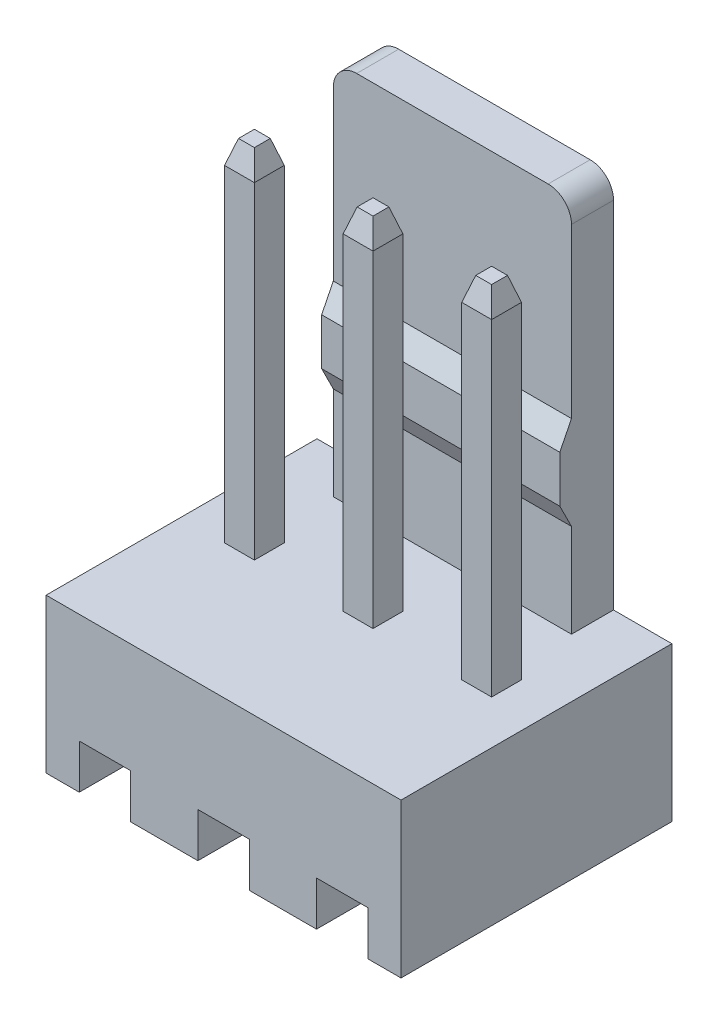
ISO-10303-21;
HEADER;
FILE_DESCRIPTION(('STEP AP214'),'2;1');
FILE_NAME('part.step','',(''),(''),'','','');
FILE_SCHEMA(('AUTOMOTIVE_DESIGN { 1 0 10303 214 1 1 1 1 }'));
ENDSEC;
DATA;
#1=APPLICATION_CONTEXT('core data for automotive mechanical design processes');
#2=APPLICATION_PROTOCOL_DEFINITION('international standard','automotive_design',2000,#1);
#3=PRODUCT_CONTEXT('',#1,'mechanical');
#4=PRODUCT('Part','Part','',(#3));
#5=PRODUCT_RELATED_PRODUCT_CATEGORY('part','',(#4));
#6=PRODUCT_DEFINITION_FORMATION('','',#4);
#7=PRODUCT_DEFINITION_CONTEXT('part definition',#1,'design');
#8=PRODUCT_DEFINITION('design','',#6,#7);
#9=PRODUCT_DEFINITION_SHAPE('','',#8);
#10=(LENGTH_UNIT() NAMED_UNIT(*) SI_UNIT(.MILLI.,.METRE.));
#11=(NAMED_UNIT(*) PLANE_ANGLE_UNIT() SI_UNIT($,.RADIAN.));
#12=(NAMED_UNIT(*) SI_UNIT($,.STERADIAN.) SOLID_ANGLE_UNIT());
#13=UNCERTAINTY_MEASURE_WITH_UNIT(LENGTH_MEASURE(1.E-05),#10,'distance_accuracy_value','');
#14=(GEOMETRIC_REPRESENTATION_CONTEXT(3) GLOBAL_UNCERTAINTY_ASSIGNED_CONTEXT((#13)) GLOBAL_UNIT_ASSIGNED_CONTEXT((#10,
#11,#12)) REPRESENTATION_CONTEXT('',''));
#15=CARTESIAN_POINT('',(0.,0.,0.));
#16=DIRECTION('',(0.,0.,1.));
#17=DIRECTION('',(1.,0.,0.));
#18=AXIS2_PLACEMENT_3D('',#15,#16,#17);
#19=CARTESIAN_POINT('',(3.8,3.3,3.2));
#20=DIRECTION('',(0.,-1.,0.));
#21=DIRECTION('',(0.,0.,-1.));
#22=AXIS2_PLACEMENT_3D('',#19,#20,#21);
#23=PLANE('',#22);
#24=DIRECTION('',(0.,0.,1.));
#25=VECTOR('',#24,1.);
#26=CARTESIAN_POINT('',(2.22,3.3,0.319999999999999));
#27=LINE('',#26,#25);
#28=CARTESIAN_POINT('',(2.22,3.3,-0.320000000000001));
#29=VERTEX_POINT('',#28);
#30=CARTESIAN_POINT('',(2.22,3.3,0.32));
#31=VERTEX_POINT('',#30);
#32=EDGE_CURVE('E343',#29,#31,#27,.T.);
#33=ORIENTED_EDGE('',*,*,#32,.F.);
#34=DIRECTION('',(-1.,0.,0.));
#35=VECTOR('',#34,1.);
#36=CARTESIAN_POINT('',(2.22,3.3,-0.320000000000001));
#37=LINE('',#36,#35);
#38=CARTESIAN_POINT('',(2.86,3.3,-0.320000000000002));
#39=VERTEX_POINT('',#38);
#40=EDGE_CURVE('E355',#39,#29,#37,.T.);
#41=ORIENTED_EDGE('',*,*,#40,.F.);
#42=DIRECTION('',(0.,0.,-1.));
#43=VECTOR('',#42,1.);
#44=CARTESIAN_POINT('',(2.86,3.3,-0.320000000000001));
#45=LINE('',#44,#43);
#46=CARTESIAN_POINT('',(2.86,3.3,0.32));
#47=VERTEX_POINT('',#46);
#48=EDGE_CURVE('E360',#47,#39,#45,.T.);
#49=ORIENTED_EDGE('',*,*,#48,.F.);
#50=DIRECTION('',(1.,0.,0.));
#51=VECTOR('',#50,1.);
#52=CARTESIAN_POINT('',(2.22,3.3,0.319999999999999));
#53=LINE('',#52,#51);
#54=EDGE_CURVE('E364',#31,#47,#53,.T.);
#55=ORIENTED_EDGE('',*,*,#54,.F.);
#56=EDGE_LOOP('',(#33,#41,#49,#55));
#57=FACE_BOUND('',#56,.T.);
#58=DIRECTION('',(0.,0.,1.));
#59=VECTOR('',#58,1.);
#60=CARTESIAN_POINT('',(-3.8,3.3,3.2));
#61=LINE('',#60,#59);
#62=CARTESIAN_POINT('',(-3.8,3.3,-2.6));
#63=VERTEX_POINT('',#62);
#64=CARTESIAN_POINT('',(-3.8,3.3,3.2));
#65=VERTEX_POINT('',#64);
#66=EDGE_CURVE('E525',#63,#65,#61,.T.);
#67=ORIENTED_EDGE('',*,*,#66,.T.);
#68=DIRECTION('',(-1.,0.,0.));
#69=VECTOR('',#68,1.);
#70=CARTESIAN_POINT('',(3.8,3.3,3.2));
#71=LINE('',#70,#69);
#72=CARTESIAN_POINT('',(3.8,3.3,3.2));
#73=VERTEX_POINT('',#72);
#74=EDGE_CURVE('E538',#73,#65,#71,.T.);
#75=ORIENTED_EDGE('',*,*,#74,.F.);
#76=DIRECTION('',(0.,0.,1.));
#77=VECTOR('',#76,1.);
#78=CARTESIAN_POINT('',(3.8,3.3,3.2));
#79=LINE('',#78,#77);
#80=CARTESIAN_POINT('',(3.8,3.30000000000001,-2.6));
#81=VERTEX_POINT('',#80);
#82=EDGE_CURVE('E536',#81,#73,#79,.T.);
#83=ORIENTED_EDGE('',*,*,#82,.F.);
#84=DIRECTION('',(-1.,0.,0.));
#85=VECTOR('',#84,1.);
#86=CARTESIAN_POINT('',(2.55,3.30000000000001,-2.6));
#87=LINE('',#86,#85);
#88=CARTESIAN_POINT('',(2.55,3.30000000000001,-2.6));
#89=VERTEX_POINT('',#88);
#90=EDGE_CURVE('E465',#81,#89,#87,.T.);
#91=ORIENTED_EDGE('',*,*,#90,.T.);
#92=DIRECTION('',(0.,0.,-1.));
#93=VECTOR('',#92,1.);
#94=CARTESIAN_POINT('',(2.55,3.30000000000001,3.2));
#95=LINE('',#94,#93);
#96=CARTESIAN_POINT('',(2.55,3.30000000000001,-1.7));
#97=VERTEX_POINT('',#96);
#98=EDGE_CURVE('E477',#97,#89,#95,.T.);
#99=ORIENTED_EDGE('',*,*,#98,.F.);
#100=DIRECTION('',(-1.,0.,0.));
#101=VECTOR('',#100,1.);
#102=CARTESIAN_POINT('',(3.8,3.3,-1.7));
#103=LINE('',#102,#101);
#104=CARTESIAN_POINT('',(-2.55,3.3,-1.7));
#105=VERTEX_POINT('',#104);
#106=EDGE_CURVE('E540',#97,#105,#103,.T.);
#107=ORIENTED_EDGE('',*,*,#106,.T.);
#108=DIRECTION('',(0.,0.,-1.));
#109=VECTOR('',#108,1.);
#110=CARTESIAN_POINT('',(-2.55,3.3,3.2));
#111=LINE('',#110,#109);
#112=CARTESIAN_POINT('',(-2.55,3.3,-2.6));
#113=VERTEX_POINT('',#112);
#114=EDGE_CURVE('E499',#105,#113,#111,.T.);
#115=ORIENTED_EDGE('',*,*,#114,.T.);
#116=DIRECTION('',(-1.,0.,0.));
#117=VECTOR('',#116,1.);
#118=CARTESIAN_POINT('',(-2.55,3.3,-2.6));
#119=LINE('',#118,#117);
#120=EDGE_CURVE('E496',#113,#63,#119,.T.);
#121=ORIENTED_EDGE('',*,*,#120,.T.);
#122=EDGE_LOOP('',(#67,#75,#83,#91,#99,#107,#115,#121));
#123=FACE_BOUND('',#122,.T.);
#124=DIRECTION('',(0.,0.,-1.));
#125=VECTOR('',#124,1.);
#126=CARTESIAN_POINT('',(0.32,3.3,0.32));
#127=LINE('',#126,#125);
#128=CARTESIAN_POINT('',(0.32,3.3,0.32));
#129=VERTEX_POINT('',#128);
#130=CARTESIAN_POINT('',(0.32,3.3,-0.32));
#131=VERTEX_POINT('',#130);
#132=EDGE_CURVE('E386',#129,#131,#127,.T.);
#133=ORIENTED_EDGE('',*,*,#132,.F.);
#134=DIRECTION('',(1.,0.,0.));
#135=VECTOR('',#134,1.);
#136=CARTESIAN_POINT('',(0.32,3.3,0.32));
#137=LINE('',#136,#135);
#138=CARTESIAN_POINT('',(-0.32,3.3,0.32));
#139=VERTEX_POINT('',#138);
#140=EDGE_CURVE('E373',#139,#129,#137,.T.);
#141=ORIENTED_EDGE('',*,*,#140,.F.);
#142=DIRECTION('',(0.,0.,1.));
#143=VECTOR('',#142,1.);
#144=CARTESIAN_POINT('',(-0.32,3.3,0.32));
#145=LINE('',#144,#143);
#146=CARTESIAN_POINT('',(-0.320000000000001,3.3,-0.32));
#147=VERTEX_POINT('',#146);
#148=EDGE_CURVE('E378',#147,#139,#145,.T.);
#149=ORIENTED_EDGE('',*,*,#148,.F.);
#150=DIRECTION('',(-1.,0.,0.));
#151=VECTOR('',#150,1.);
#152=CARTESIAN_POINT('',(0.32,3.3,-0.32));
#153=LINE('',#152,#151);
#154=EDGE_CURVE('E382',#131,#147,#153,.T.);
#155=ORIENTED_EDGE('',*,*,#154,.F.);
#156=EDGE_LOOP('',(#133,#141,#149,#155));
#157=FACE_BOUND('',#156,.T.);
#158=DIRECTION('',(0.,0.,-1.));
#159=VECTOR('',#158,1.);
#160=CARTESIAN_POINT('',(-2.22,3.3,0.32));
#161=LINE('',#160,#159);
#162=CARTESIAN_POINT('',(-2.22,3.3,0.32));
#163=VERTEX_POINT('',#162);
#164=CARTESIAN_POINT('',(-2.22,3.3,-0.32));
#165=VERTEX_POINT('',#164);
#166=EDGE_CURVE('E320',#163,#165,#161,.T.);
#167=ORIENTED_EDGE('',*,*,#166,.F.);
#168=DIRECTION('',(1.,0.,0.));
#169=VECTOR('',#168,1.);
#170=CARTESIAN_POINT('',(-2.22,3.3,0.32));
#171=LINE('',#170,#169);
#172=CARTESIAN_POINT('',(-2.86,3.3,0.32));
#173=VERTEX_POINT('',#172);
#174=EDGE_CURVE('E332',#173,#163,#171,.T.);
#175=ORIENTED_EDGE('',*,*,#174,.F.);
#176=DIRECTION('',(0.,0.,1.));
#177=VECTOR('',#176,1.);
#178=CARTESIAN_POINT('',(-2.86,3.3,0.32));
#179=LINE('',#178,#177);
#180=CARTESIAN_POINT('',(-2.86,3.3,-0.32));
#181=VERTEX_POINT('',#180);
#182=EDGE_CURVE('E345',#181,#173,#179,.T.);
#183=ORIENTED_EDGE('',*,*,#182,.F.);
#184=DIRECTION('',(-1.,0.,0.));
#185=VECTOR('',#184,1.);
#186=CARTESIAN_POINT('',(-2.22,3.3,-0.32));
#187=LINE('',#186,#185);
#188=EDGE_CURVE('E335',#165,#181,#187,.T.);
#189=ORIENTED_EDGE('',*,*,#188,.F.);
#190=EDGE_LOOP('',(#167,#175,#183,#189));
#191=FACE_BOUND('',#190,.T.);
#192=ADVANCED_FACE('F36',(#57,#123,#157,#191),#23,.F.);
#193=CARTESIAN_POINT('',(3.8,0.,3.2));
#194=DIRECTION('',(0.,1.,0.));
#195=DIRECTION('',(0.,0.,1.));
#196=AXIS2_PLACEMENT_3D('',#193,#194,#195);
#197=PLANE('',#196);
#198=DIRECTION('',(-1.,0.,0.));
#199=VECTOR('',#198,1.);
#200=CARTESIAN_POINT('',(3.8,0.,3.2));
#201=LINE('',#200,#199);
#202=CARTESIAN_POINT('',(-0.550000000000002,0.,3.2));
#203=VERTEX_POINT('',#202);
#204=CARTESIAN_POINT('',(-1.99,0.,3.2));
#205=VERTEX_POINT('',#204);
#206=EDGE_CURVE('E569',#203,#205,#201,.T.);
#207=ORIENTED_EDGE('',*,*,#206,.T.);
#208=DIRECTION('',(0.,0.,-1.));
#209=VECTOR('',#208,1.);
#210=CARTESIAN_POINT('',(-1.99,0.,3.2));
#211=LINE('',#210,#209);
#212=CARTESIAN_POINT('',(-1.99,0.,-2.6));
#213=VERTEX_POINT('',#212);
#214=EDGE_CURVE('E409',#205,#213,#211,.T.);
#215=ORIENTED_EDGE('',*,*,#214,.T.);
#216=DIRECTION('',(-1.,0.,0.));
#217=VECTOR('',#216,1.);
#218=CARTESIAN_POINT('',(3.8,0.,-2.6));
#219=LINE('',#218,#217);
#220=CARTESIAN_POINT('',(-0.55,0.,-2.6));
#221=VERTEX_POINT('',#220);
#222=EDGE_CURVE('E563',#221,#213,#219,.T.);
#223=ORIENTED_EDGE('',*,*,#222,.F.);
#224=DIRECTION('',(0.,0.,-1.));
#225=VECTOR('',#224,1.);
#226=CARTESIAN_POINT('',(-0.550000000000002,0.,3.2));
#227=LINE('',#226,#225);
#228=EDGE_CURVE('E468',#203,#221,#227,.T.);
#229=ORIENTED_EDGE('',*,*,#228,.F.);
#230=EDGE_LOOP('',(#207,#215,#223,#229));
#231=FACE_BOUND('',#230,.T.);
#232=ADVANCED_FACE('F721',(#231),#197,.F.);
#233=CARTESIAN_POINT('',(1.99,0.,-2.6));
#234=VERTEX_POINT('',#233);
#235=CARTESIAN_POINT('',(0.549999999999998,0.,-2.6));
#236=VERTEX_POINT('',#235);
#237=EDGE_CURVE('E562',#234,#236,#219,.T.);
#238=ORIENTED_EDGE('',*,*,#237,.F.);
#239=DIRECTION('',(0.,0.,-1.));
#240=VECTOR('',#239,1.);
#241=CARTESIAN_POINT('',(1.99,0.,3.2));
#242=LINE('',#241,#240);
#243=CARTESIAN_POINT('',(1.99,0.,3.2));
#244=VERTEX_POINT('',#243);
#245=EDGE_CURVE('E435',#244,#234,#242,.T.);
#246=ORIENTED_EDGE('',*,*,#245,.F.);
#247=CARTESIAN_POINT('',(0.549999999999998,0.,3.2));
#248=VERTEX_POINT('',#247);
#249=EDGE_CURVE('E568',#244,#248,#201,.T.);
#250=ORIENTED_EDGE('',*,*,#249,.T.);
#251=DIRECTION('',(0.,0.,-1.));
#252=VECTOR('',#251,1.);
#253=CARTESIAN_POINT('',(0.549999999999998,0.,3.2));
#254=LINE('',#253,#252);
#255=EDGE_CURVE('E462',#248,#236,#254,.T.);
#256=ORIENTED_EDGE('',*,*,#255,.T.);
#257=EDGE_LOOP('',(#238,#246,#250,#256));
#258=FACE_BOUND('',#257,.T.);
#259=ADVANCED_FACE('F726',(#258),#197,.F.);
#260=CARTESIAN_POINT('',(3.8,0.,3.2));
#261=VERTEX_POINT('',#260);
#262=CARTESIAN_POINT('',(3.09,0.,3.2));
#263=VERTEX_POINT('',#262);
#264=EDGE_CURVE('E564',#261,#263,#201,.T.);
#265=ORIENTED_EDGE('',*,*,#264,.T.);
#266=DIRECTION('',(0.,0.,-1.));
#267=VECTOR('',#266,1.);
#268=CARTESIAN_POINT('',(3.09,0.,3.2));
#269=LINE('',#268,#267);
#270=CARTESIAN_POINT('',(3.09,0.,-2.6));
#271=VERTEX_POINT('',#270);
#272=EDGE_CURVE('E438',#263,#271,#269,.T.);
#273=ORIENTED_EDGE('',*,*,#272,.T.);
#274=CARTESIAN_POINT('',(3.8,0.,-2.6));
#275=VERTEX_POINT('',#274);
#276=EDGE_CURVE('E558',#275,#271,#219,.T.);
#277=ORIENTED_EDGE('',*,*,#276,.F.);
#278=DIRECTION('',(0.,0.,-1.));
#279=VECTOR('',#278,1.);
#280=CARTESIAN_POINT('',(3.8,0.,3.2));
#281=LINE('',#280,#279);
#282=EDGE_CURVE('E531',#261,#275,#281,.T.);
#283=ORIENTED_EDGE('',*,*,#282,.F.);
#284=EDGE_LOOP('',(#265,#273,#277,#283));
#285=FACE_BOUND('',#284,.T.);
#286=ADVANCED_FACE('F762',(#285),#197,.F.);
#287=CARTESIAN_POINT('',(3.8,0.,3.2));
#288=DIRECTION('',(0.,0.,-1.));
#289=DIRECTION('',(-1.,0.,0.));
#290=AXIS2_PLACEMENT_3D('',#287,#288,#289);
#291=PLANE('',#290);
#292=DIRECTION('',(1.,0.,0.));
#293=VECTOR('',#292,1.);
#294=CARTESIAN_POINT('',(-1.99,0.95,3.2));
#295=LINE('',#294,#293);
#296=CARTESIAN_POINT('',(-3.09,0.95,3.2));
#297=VERTEX_POINT('',#296);
#298=CARTESIAN_POINT('',(-1.99,0.95,3.2));
#299=VERTEX_POINT('',#298);
#300=EDGE_CURVE('E406',#297,#299,#295,.T.);
#301=ORIENTED_EDGE('',*,*,#300,.T.);
#302=DIRECTION('',(0.,-1.,0.));
#303=VECTOR('',#302,1.);
#304=CARTESIAN_POINT('',(-1.99,0.95,3.2));
#305=LINE('',#304,#303);
#306=EDGE_CURVE('E400',#299,#205,#305,.T.);
#307=ORIENTED_EDGE('',*,*,#306,.T.);
#308=ORIENTED_EDGE('',*,*,#206,.F.);
#309=DIRECTION('',(0.,1.,0.));
#310=VECTOR('',#309,1.);
#311=CARTESIAN_POINT('',(-0.550000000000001,0.95,3.2));
#312=LINE('',#311,#310);
#313=CARTESIAN_POINT('',(-0.550000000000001,0.95,3.2));
#314=VERTEX_POINT('',#313);
#315=EDGE_CURVE('E456',#203,#314,#312,.T.);
#316=ORIENTED_EDGE('',*,*,#315,.T.);
#317=DIRECTION('',(1.,0.,0.));
#318=VECTOR('',#317,1.);
#319=CARTESIAN_POINT('',(0.549999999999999,0.95,3.2));
#320=LINE('',#319,#318);
#321=CARTESIAN_POINT('',(0.549999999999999,0.95,3.2));
#322=VERTEX_POINT('',#321);
#323=EDGE_CURVE('E459',#314,#322,#320,.T.);
#324=ORIENTED_EDGE('',*,*,#323,.T.);
#325=DIRECTION('',(0.,-1.,0.));
#326=VECTOR('',#325,1.);
#327=CARTESIAN_POINT('',(0.549999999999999,0.95,3.2));
#328=LINE('',#327,#326);
#329=EDGE_CURVE('E453',#322,#248,#328,.T.);
#330=ORIENTED_EDGE('',*,*,#329,.T.);
#331=ORIENTED_EDGE('',*,*,#249,.F.);
#332=DIRECTION('',(0.,1.,0.));
#333=VECTOR('',#332,1.);
#334=CARTESIAN_POINT('',(1.99,0.950000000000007,3.2));
#335=LINE('',#334,#333);
#336=CARTESIAN_POINT('',(1.99,0.950000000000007,3.2));
#337=VERTEX_POINT('',#336);
#338=EDGE_CURVE('E425',#244,#337,#335,.T.);
#339=ORIENTED_EDGE('',*,*,#338,.T.);
#340=DIRECTION('',(1.,0.,0.));
#341=VECTOR('',#340,1.);
#342=CARTESIAN_POINT('',(1.99,0.950000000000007,3.2));
#343=LINE('',#342,#341);
#344=CARTESIAN_POINT('',(3.09,0.950000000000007,3.2));
#345=VERTEX_POINT('',#344);
#346=EDGE_CURVE('E428',#337,#345,#343,.T.);
#347=ORIENTED_EDGE('',*,*,#346,.T.);
#348=DIRECTION('',(0.,-1.,0.));
#349=VECTOR('',#348,1.);
#350=CARTESIAN_POINT('',(3.09,0.950000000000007,3.2));
#351=LINE('',#350,#349);
#352=EDGE_CURVE('E431',#345,#263,#351,.T.);
#353=ORIENTED_EDGE('',*,*,#352,.T.);
#354=ORIENTED_EDGE('',*,*,#264,.F.);
#355=DIRECTION('',(0.,-1.,0.));
#356=VECTOR('',#355,1.);
#357=CARTESIAN_POINT('',(3.8,0.,3.2));
#358=LINE('',#357,#356);
#359=EDGE_CURVE('E528',#73,#261,#358,.T.);
#360=ORIENTED_EDGE('',*,*,#359,.F.);
#361=ORIENTED_EDGE('',*,*,#74,.T.);
#362=DIRECTION('',(0.,-1.,0.));
#363=VECTOR('',#362,1.);
#364=CARTESIAN_POINT('',(-3.8,0.,3.2));
#365=LINE('',#364,#363);
#366=CARTESIAN_POINT('',(-3.8,0.,3.2));
#367=VERTEX_POINT('',#366);
#368=EDGE_CURVE('E516',#65,#367,#365,.T.);
#369=ORIENTED_EDGE('',*,*,#368,.T.);
#370=CARTESIAN_POINT('',(-3.09,0.,3.2));
#371=VERTEX_POINT('',#370);
#372=EDGE_CURVE('E561',#371,#367,#201,.T.);
#373=ORIENTED_EDGE('',*,*,#372,.F.);
#374=DIRECTION('',(0.,1.,0.));
#375=VECTOR('',#374,1.);
#376=CARTESIAN_POINT('',(-3.09,0.95,3.2));
#377=LINE('',#376,#375);
#378=EDGE_CURVE('E403',#371,#297,#377,.T.);
#379=ORIENTED_EDGE('',*,*,#378,.T.);
#380=EDGE_LOOP('',(#301,#307,#308,#316,#324,#330,#331,#339,#347,#353,#354,#360,#361,#369,#373,#379));
#381=FACE_BOUND('',#380,.T.);
#382=ADVANCED_FACE('F38',(#381),#291,.F.);
#383=CARTESIAN_POINT('',(-3.09,0.,-2.6));
#384=VERTEX_POINT('',#383);
#385=CARTESIAN_POINT('',(-3.8,0.,-2.6));
#386=VERTEX_POINT('',#385);
#387=EDGE_CURVE('E557',#384,#386,#219,.T.);
#388=ORIENTED_EDGE('',*,*,#387,.F.);
#389=DIRECTION('',(0.,0.,-1.));
#390=VECTOR('',#389,1.);
#391=CARTESIAN_POINT('',(-3.09,0.,3.2));
#392=LINE('',#391,#390);
#393=EDGE_CURVE('E415',#371,#384,#392,.T.);
#394=ORIENTED_EDGE('',*,*,#393,.F.);
#395=ORIENTED_EDGE('',*,*,#372,.T.);
#396=DIRECTION('',(0.,0.,-1.));
#397=VECTOR('',#396,1.);
#398=CARTESIAN_POINT('',(-3.8,0.,3.2));
#399=LINE('',#398,#397);
#400=EDGE_CURVE('E519',#367,#386,#399,.T.);
#401=ORIENTED_EDGE('',*,*,#400,.T.);
#402=EDGE_LOOP('',(#388,#394,#395,#401));
#403=FACE_BOUND('',#402,.T.);
#404=ADVANCED_FACE('F728',(#403),#197,.F.);
#405=CARTESIAN_POINT('',(3.8,0.,-2.6));
#406=DIRECTION('',(0.,0.,1.));
#407=DIRECTION('',(0.,-1.,0.));
#408=AXIS2_PLACEMENT_3D('',#405,#406,#407);
#409=PLANE('',#408);
#410=DIRECTION('',(0.,-1.,0.));
#411=VECTOR('',#410,1.);
#412=CARTESIAN_POINT('',(-2.55,12.4,-2.6));
#413=LINE('',#412,#411);
#414=CARTESIAN_POINT('',(-2.55,10.9,-2.6));
#415=VERTEX_POINT('',#414);
#416=EDGE_CURVE('E494',#415,#113,#413,.T.);
#417=ORIENTED_EDGE('',*,*,#416,.F.);
#418=CARTESIAN_POINT('',(-2.05,10.9,-2.6));
#419=DIRECTION('',(0.,0.,1.));
#420=DIRECTION('',(0.,-1.,0.));
#421=AXIS2_PLACEMENT_3D('',#418,#419,#420);
#422=CIRCLE('',#421,0.5);
#423=CARTESIAN_POINT('',(-2.05,11.4,-2.6));
#424=VERTEX_POINT('',#423);
#425=EDGE_CURVE('E583',#415,#424,#422,.F.);
#426=ORIENTED_EDGE('',*,*,#425,.T.);
#427=DIRECTION('',(-1.,0.,0.));
#428=VECTOR('',#427,1.);
#429=CARTESIAN_POINT('',(3.8,11.4,-2.6));
#430=LINE('',#429,#428);
#431=CARTESIAN_POINT('',(2.05,11.4,-2.6));
#432=VERTEX_POINT('',#431);
#433=EDGE_CURVE('E554',#432,#424,#430,.T.);
#434=ORIENTED_EDGE('',*,*,#433,.F.);
#435=CARTESIAN_POINT('',(2.05,10.9,-2.6));
#436=DIRECTION('',(0.,0.,1.));
#437=DIRECTION('',(0.,-1.,0.));
#438=AXIS2_PLACEMENT_3D('',#435,#436,#437);
#439=CIRCLE('',#438,0.5);
#440=CARTESIAN_POINT('',(2.55,10.9,-2.6));
#441=VERTEX_POINT('',#440);
#442=EDGE_CURVE('E581',#432,#441,#439,.F.);
#443=ORIENTED_EDGE('',*,*,#442,.T.);
#444=DIRECTION('',(0.,1.,0.));
#445=VECTOR('',#444,1.);
#446=CARTESIAN_POINT('',(2.55,12.4,-2.6));
#447=LINE('',#446,#445);
#448=EDGE_CURVE('E474',#89,#441,#447,.T.);
#449=ORIENTED_EDGE('',*,*,#448,.F.);
#450=ORIENTED_EDGE('',*,*,#90,.F.);
#451=DIRECTION('',(0.,1.,0.));
#452=VECTOR('',#451,1.);
#453=CARTESIAN_POINT('',(3.8,0.,-2.6));
#454=LINE('',#453,#452);
#455=EDGE_CURVE('E533',#275,#81,#454,.T.);
#456=ORIENTED_EDGE('',*,*,#455,.F.);
#457=ORIENTED_EDGE('',*,*,#276,.T.);
#458=DIRECTION('',(0.,-1.,0.));
#459=VECTOR('',#458,1.);
#460=CARTESIAN_POINT('',(3.09,0.950000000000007,-2.6));
#461=LINE('',#460,#459);
#462=CARTESIAN_POINT('',(3.09,0.950000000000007,-2.6));
#463=VERTEX_POINT('',#462);
#464=EDGE_CURVE('E423',#463,#271,#461,.T.);
#465=ORIENTED_EDGE('',*,*,#464,.F.);
#466=DIRECTION('',(1.,0.,0.));
#467=VECTOR('',#466,1.);
#468=CARTESIAN_POINT('',(1.99,0.950000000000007,-2.6));
#469=LINE('',#468,#467);
#470=CARTESIAN_POINT('',(1.99,0.950000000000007,-2.6));
#471=VERTEX_POINT('',#470);
#472=EDGE_CURVE('E420',#471,#463,#469,.T.);
#473=ORIENTED_EDGE('',*,*,#472,.F.);
#474=DIRECTION('',(0.,1.,0.));
#475=VECTOR('',#474,1.);
#476=CARTESIAN_POINT('',(1.99,0.950000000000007,-2.6));
#477=LINE('',#476,#475);
#478=EDGE_CURVE('E412',#234,#471,#477,.T.);
#479=ORIENTED_EDGE('',*,*,#478,.F.);
#480=ORIENTED_EDGE('',*,*,#237,.T.);
#481=DIRECTION('',(0.,-1.,0.));
#482=VECTOR('',#481,1.);
#483=CARTESIAN_POINT('',(0.549999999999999,0.95,-2.6));
#484=LINE('',#483,#482);
#485=CARTESIAN_POINT('',(0.549999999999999,0.95,-2.6));
#486=VERTEX_POINT('',#485);
#487=EDGE_CURVE('E437',#486,#236,#484,.T.);
#488=ORIENTED_EDGE('',*,*,#487,.F.);
#489=DIRECTION('',(1.,0.,0.));
#490=VECTOR('',#489,1.);
#491=CARTESIAN_POINT('',(0.549999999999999,0.95,-2.6));
#492=LINE('',#491,#490);
#493=CARTESIAN_POINT('',(-0.550000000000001,0.95,-2.6));
#494=VERTEX_POINT('',#493);
#495=EDGE_CURVE('E450',#494,#486,#492,.T.);
#496=ORIENTED_EDGE('',*,*,#495,.F.);
#497=DIRECTION('',(0.,1.,0.));
#498=VECTOR('',#497,1.);
#499=CARTESIAN_POINT('',(-0.550000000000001,0.95,-2.6));
#500=LINE('',#499,#498);
#501=EDGE_CURVE('E447',#221,#494,#500,.T.);
#502=ORIENTED_EDGE('',*,*,#501,.F.);
#503=ORIENTED_EDGE('',*,*,#222,.T.);
#504=DIRECTION('',(0.,-1.,0.));
#505=VECTOR('',#504,1.);
#506=CARTESIAN_POINT('',(-1.99,0.95,-2.6));
#507=LINE('',#506,#505);
#508=CARTESIAN_POINT('',(-1.99,0.95,-2.6));
#509=VERTEX_POINT('',#508);
#510=EDGE_CURVE('E376',#509,#213,#507,.T.);
#511=ORIENTED_EDGE('',*,*,#510,.F.);
#512=DIRECTION('',(1.,0.,0.));
#513=VECTOR('',#512,1.);
#514=CARTESIAN_POINT('',(-1.99,0.95,-2.6));
#515=LINE('',#514,#513);
#516=CARTESIAN_POINT('',(-3.09,0.95,-2.6));
#517=VERTEX_POINT('',#516);
#518=EDGE_CURVE('E397',#517,#509,#515,.T.);
#519=ORIENTED_EDGE('',*,*,#518,.F.);
#520=DIRECTION('',(0.,1.,0.));
#521=VECTOR('',#520,1.);
#522=CARTESIAN_POINT('',(-3.09,0.95,-2.6));
#523=LINE('',#522,#521);
#524=EDGE_CURVE('E394',#384,#517,#523,.T.);
#525=ORIENTED_EDGE('',*,*,#524,.F.);
#526=ORIENTED_EDGE('',*,*,#387,.T.);
#527=DIRECTION('',(0.,1.,0.));
#528=VECTOR('',#527,1.);
#529=CARTESIAN_POINT('',(-3.8,0.,-2.6));
#530=LINE('',#529,#528);
#531=EDGE_CURVE('E522',#386,#63,#530,.T.);
#532=ORIENTED_EDGE('',*,*,#531,.T.);
#533=ORIENTED_EDGE('',*,*,#120,.F.);
#534=EDGE_LOOP('',(#417,#426,#434,#443,#449,#450,#456,#457,#465,#473,#479,#480,#488,#496,#502,
#503,#511,#519,#525,#526,#532,#533));
#535=FACE_BOUND('',#534,.T.);
#536=ADVANCED_FACE('F756',(#535),#409,.F.);
#537=CARTESIAN_POINT('',(3.8,11.4,-2.6));
#538=DIRECTION('',(0.,-1.,0.));
#539=DIRECTION('',(0.,0.,-1.));
#540=AXIS2_PLACEMENT_3D('',#537,#538,#539);
#541=PLANE('',#540);
#542=ORIENTED_EDGE('',*,*,#433,.T.);
#543=DIRECTION('',(0.,0.,1.));
#544=VECTOR('',#543,1.);
#545=CARTESIAN_POINT('',(-2.05,11.4,-2.6));
#546=LINE('',#545,#544);
#547=CARTESIAN_POINT('',(-2.05,11.4,-1.7));
#548=VERTEX_POINT('',#547);
#549=EDGE_CURVE('E572',#424,#548,#546,.T.);
#550=ORIENTED_EDGE('',*,*,#549,.T.);
#551=DIRECTION('',(-1.,0.,0.));
#552=VECTOR('',#551,1.);
#553=CARTESIAN_POINT('',(3.8,11.4,-1.7));
#554=LINE('',#553,#552);
#555=CARTESIAN_POINT('',(2.05,11.4,-1.7));
#556=VERTEX_POINT('',#555);
#557=EDGE_CURVE('E551',#556,#548,#554,.T.);
#558=ORIENTED_EDGE('',*,*,#557,.F.);
#559=DIRECTION('',(0.,0.,-1.));
#560=VECTOR('',#559,1.);
#561=CARTESIAN_POINT('',(2.05,11.4,-2.6));
#562=LINE('',#561,#560);
#563=EDGE_CURVE('E567',#556,#432,#562,.T.);
#564=ORIENTED_EDGE('',*,*,#563,.T.);
#565=EDGE_LOOP('',(#542,#550,#558,#564));
#566=FACE_BOUND('',#565,.T.);
#567=ADVANCED_FACE('F752',(#566),#541,.F.);
#568=CARTESIAN_POINT('',(3.8,11.4,-1.7));
#569=DIRECTION('',(0.,0.,-1.));
#570=DIRECTION('',(0.,1.,0.));
#571=AXIS2_PLACEMENT_3D('',#568,#569,#570);
#572=PLANE('',#571);
#573=ORIENTED_EDGE('',*,*,#557,.T.);
#574=CARTESIAN_POINT('',(-2.05,10.9,-1.7));
#575=DIRECTION('',(0.,0.,-1.));
#576=DIRECTION('',(0.,1.,0.));
#577=AXIS2_PLACEMENT_3D('',#574,#575,#576);
#578=CIRCLE('',#577,0.5);
#579=CARTESIAN_POINT('',(-2.55,10.9,-1.7));
#580=VERTEX_POINT('',#579);
#581=EDGE_CURVE('E577',#548,#580,#578,.F.);
#582=ORIENTED_EDGE('',*,*,#581,.T.);
#583=DIRECTION('',(0.,-1.,0.));
#584=VECTOR('',#583,1.);
#585=CARTESIAN_POINT('',(-2.55,11.4,-1.7));
#586=LINE('',#585,#584);
#587=CARTESIAN_POINT('',(-2.55,7.3,-1.7));
#588=VERTEX_POINT('',#587);
#589=EDGE_CURVE('E514',#580,#588,#586,.T.);
#590=ORIENTED_EDGE('',*,*,#589,.T.);
#591=DIRECTION('',(-1.,0.,0.));
#592=VECTOR('',#591,1.);
#593=CARTESIAN_POINT('',(3.8,7.3,-1.7));
#594=LINE('',#593,#592);
#595=CARTESIAN_POINT('',(2.55,7.3,-1.7));
#596=VERTEX_POINT('',#595);
#597=EDGE_CURVE('E548',#596,#588,#594,.T.);
#598=ORIENTED_EDGE('',*,*,#597,.F.);
#599=DIRECTION('',(0.,1.,0.));
#600=VECTOR('',#599,1.);
#601=CARTESIAN_POINT('',(2.55,11.4,-1.7));
#602=LINE('',#601,#600);
#603=CARTESIAN_POINT('',(2.55,10.9,-1.7));
#604=VERTEX_POINT('',#603);
#605=EDGE_CURVE('E491',#596,#604,#602,.T.);
#606=ORIENTED_EDGE('',*,*,#605,.T.);
#607=CARTESIAN_POINT('',(2.05,10.9,-1.7));
#608=DIRECTION('',(0.,0.,-1.));
#609=DIRECTION('',(0.,1.,0.));
#610=AXIS2_PLACEMENT_3D('',#607,#608,#609);
#611=CIRCLE('',#610,0.5);
#612=EDGE_CURVE('E575',#604,#556,#611,.F.);
#613=ORIENTED_EDGE('',*,*,#612,.T.);
#614=EDGE_LOOP('',(#573,#582,#590,#598,#606,#613));
#615=FACE_BOUND('',#614,.T.);
#616=ADVANCED_FACE('F748',(#615),#572,.F.);
#617=CARTESIAN_POINT('',(3.8,7.3,-1.7));
#618=DIRECTION('',(0.,-0.44721359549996,-0.894427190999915));
#619=DIRECTION('',(0.,0.894427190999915,-0.44721359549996));
#620=AXIS2_PLACEMENT_3D('',#617,#618,#619);
#621=PLANE('',#620);
#622=DIRECTION('',(-1.,0.,0.));
#623=VECTOR('',#622,1.);
#624=CARTESIAN_POINT('',(3.8,6.8,-1.45));
#625=LINE('',#624,#623);
#626=CARTESIAN_POINT('',(2.55,6.8,-1.45));
#627=VERTEX_POINT('',#626);
#628=CARTESIAN_POINT('',(-2.55,6.8,-1.45));
#629=VERTEX_POINT('',#628);
#630=EDGE_CURVE('E546',#627,#629,#625,.T.);
#631=ORIENTED_EDGE('',*,*,#630,.F.);
#632=DIRECTION('',(0.,0.894427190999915,-0.44721359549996));
#633=VECTOR('',#632,1.);
#634=CARTESIAN_POINT('',(2.55,7.3,-1.7));
#635=LINE('',#634,#633);
#636=EDGE_CURVE('E488',#627,#596,#635,.T.);
#637=ORIENTED_EDGE('',*,*,#636,.T.);
#638=ORIENTED_EDGE('',*,*,#597,.T.);
#639=DIRECTION('',(0.,-0.894427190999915,0.44721359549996));
#640=VECTOR('',#639,1.);
#641=CARTESIAN_POINT('',(-2.55,7.3,-1.7));
#642=LINE('',#641,#640);
#643=EDGE_CURVE('E511',#588,#629,#642,.T.);
#644=ORIENTED_EDGE('',*,*,#643,.T.);
#645=EDGE_LOOP('',(#631,#637,#638,#644));
#646=FACE_BOUND('',#645,.T.);
#647=ADVANCED_FACE('F744',(#646),#621,.F.);
#648=CARTESIAN_POINT('',(3.8,6.8,-1.45));
#649=DIRECTION('',(0.,0.,-1.));
#650=DIRECTION('',(-1.,0.,0.));
#651=AXIS2_PLACEMENT_3D('',#648,#649,#650);
#652=PLANE('',#651);
#653=DIRECTION('',(-1.,0.,0.));
#654=VECTOR('',#653,1.);
#655=CARTESIAN_POINT('',(3.8,5.8,-1.45));
#656=LINE('',#655,#654);
#657=CARTESIAN_POINT('',(2.55,5.8,-1.45));
#658=VERTEX_POINT('',#657);
#659=CARTESIAN_POINT('',(-2.55,5.8,-1.45));
#660=VERTEX_POINT('',#659);
#661=EDGE_CURVE('E544',#658,#660,#656,.T.);
#662=ORIENTED_EDGE('',*,*,#661,.F.);
#663=DIRECTION('',(0.,1.,0.));
#664=VECTOR('',#663,1.);
#665=CARTESIAN_POINT('',(2.55,6.8,-1.45));
#666=LINE('',#665,#664);
#667=EDGE_CURVE('E485',#658,#627,#666,.T.);
#668=ORIENTED_EDGE('',*,*,#667,.T.);
#669=ORIENTED_EDGE('',*,*,#630,.T.);
#670=DIRECTION('',(0.,-1.,0.));
#671=VECTOR('',#670,1.);
#672=CARTESIAN_POINT('',(-2.55,6.8,-1.45));
#673=LINE('',#672,#671);
#674=EDGE_CURVE('E508',#629,#660,#673,.T.);
#675=ORIENTED_EDGE('',*,*,#674,.T.);
#676=EDGE_LOOP('',(#662,#668,#669,#675));
#677=FACE_BOUND('',#676,.T.);
#678=ADVANCED_FACE('F740',(#677),#652,.F.);
#679=CARTESIAN_POINT('',(3.8,5.8,-1.45));
#680=DIRECTION('',(0.,0.44721359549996,-0.894427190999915));
#681=DIRECTION('',(0.,0.894427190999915,0.44721359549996));
#682=AXIS2_PLACEMENT_3D('',#679,#680,#681);
#683=PLANE('',#682);
#684=DIRECTION('',(-1.,0.,0.));
#685=VECTOR('',#684,1.);
#686=CARTESIAN_POINT('',(3.8,5.3,-1.7));
#687=LINE('',#686,#685);
#688=CARTESIAN_POINT('',(2.55,5.3,-1.7));
#689=VERTEX_POINT('',#688);
#690=CARTESIAN_POINT('',(-2.55,5.3,-1.7));
#691=VERTEX_POINT('',#690);
#692=EDGE_CURVE('E542',#689,#691,#687,.T.);
#693=ORIENTED_EDGE('',*,*,#692,.F.);
#694=DIRECTION('',(0.,0.894427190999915,0.44721359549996));
#695=VECTOR('',#694,1.);
#696=CARTESIAN_POINT('',(2.55,5.8,-1.45));
#697=LINE('',#696,#695);
#698=EDGE_CURVE('E482',#689,#658,#697,.T.);
#699=ORIENTED_EDGE('',*,*,#698,.T.);
#700=ORIENTED_EDGE('',*,*,#661,.T.);
#701=DIRECTION('',(0.,-0.894427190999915,-0.44721359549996));
#702=VECTOR('',#701,1.);
#703=CARTESIAN_POINT('',(-2.55,5.8,-1.45));
#704=LINE('',#703,#702);
#705=EDGE_CURVE('E505',#660,#691,#704,.T.);
#706=ORIENTED_EDGE('',*,*,#705,.T.);
#707=EDGE_LOOP('',(#693,#699,#700,#706));
#708=FACE_BOUND('',#707,.T.);
#709=ADVANCED_FACE('F736',(#708),#683,.F.);
#710=CARTESIAN_POINT('',(3.8,5.3,-1.7));
#711=DIRECTION('',(0.,0.,-1.));
#712=DIRECTION('',(0.,1.,0.));
#713=AXIS2_PLACEMENT_3D('',#710,#711,#712);
#714=PLANE('',#713);
#715=ORIENTED_EDGE('',*,*,#106,.F.);
#716=DIRECTION('',(0.,1.,0.));
#717=VECTOR('',#716,1.);
#718=CARTESIAN_POINT('',(2.55,5.3,-1.7));
#719=LINE('',#718,#717);
#720=EDGE_CURVE('E479',#97,#689,#719,.T.);
#721=ORIENTED_EDGE('',*,*,#720,.T.);
#722=ORIENTED_EDGE('',*,*,#692,.T.);
#723=DIRECTION('',(0.,-1.,0.));
#724=VECTOR('',#723,1.);
#725=CARTESIAN_POINT('',(-2.55,5.3,-1.7));
#726=LINE('',#725,#724);
#727=EDGE_CURVE('E502',#691,#105,#726,.T.);
#728=ORIENTED_EDGE('',*,*,#727,.T.);
#729=EDGE_LOOP('',(#715,#721,#722,#728));
#730=FACE_BOUND('',#729,.T.);
#731=ADVANCED_FACE('F733',(#730),#714,.F.);
#732=CARTESIAN_POINT('',(3.8,3.3,3.2));
#733=DIRECTION('',(-1.,0.,0.));
#734=DIRECTION('',(0.,0.,1.));
#735=AXIS2_PLACEMENT_3D('',#732,#733,#734);
#736=PLANE('',#735);
#737=ORIENTED_EDGE('',*,*,#455,.T.);
#738=ORIENTED_EDGE('',*,*,#82,.T.);
#739=ORIENTED_EDGE('',*,*,#359,.T.);
#740=ORIENTED_EDGE('',*,*,#282,.T.);
#741=EDGE_LOOP('',(#737,#738,#739,#740));
#742=FACE_BOUND('',#741,.T.);
#743=ADVANCED_FACE('F731',(#742),#736,.F.);
#744=CARTESIAN_POINT('',(-3.8,3.3,3.2));
#745=DIRECTION('',(-1.,0.,0.));
#746=DIRECTION('',(0.,0.,1.));
#747=AXIS2_PLACEMENT_3D('',#744,#745,#746);
#748=PLANE('',#747);
#749=ORIENTED_EDGE('',*,*,#66,.F.);
#750=ORIENTED_EDGE('',*,*,#531,.F.);
#751=ORIENTED_EDGE('',*,*,#400,.F.);
#752=ORIENTED_EDGE('',*,*,#368,.F.);
#753=EDGE_LOOP('',(#749,#750,#751,#752));
#754=FACE_BOUND('',#753,.T.);
#755=ADVANCED_FACE('F795',(#754),#748,.T.);
#756=CARTESIAN_POINT('',(-2.55,12.4,3.2));
#757=DIRECTION('',(1.,0.,0.));
#758=DIRECTION('',(0.,1.,0.));
#759=AXIS2_PLACEMENT_3D('',#756,#757,#758);
#760=PLANE('',#759);
#761=ORIENTED_EDGE('',*,*,#589,.F.);
#762=DIRECTION('',(0.,0.,1.));
#763=VECTOR('',#762,1.);
#764=CARTESIAN_POINT('',(-2.55,10.9,3.2));
#765=LINE('',#764,#763);
#766=EDGE_CURVE('E579',#580,#415,#765,.F.);
#767=ORIENTED_EDGE('',*,*,#766,.T.);
#768=ORIENTED_EDGE('',*,*,#416,.T.);
#769=ORIENTED_EDGE('',*,*,#114,.F.);
#770=ORIENTED_EDGE('',*,*,#727,.F.);
#771=ORIENTED_EDGE('',*,*,#705,.F.);
#772=ORIENTED_EDGE('',*,*,#674,.F.);
#773=ORIENTED_EDGE('',*,*,#643,.F.);
#774=EDGE_LOOP('',(#761,#767,#768,#769,#770,#771,#772,#773));
#775=FACE_BOUND('',#774,.T.);
#776=ADVANCED_FACE('F846',(#775),#760,.F.);
#777=CARTESIAN_POINT('',(2.55,12.4,3.2));
#778=DIRECTION('',(-1.,0.,0.));
#779=DIRECTION('',(0.,-1.,0.));
#780=AXIS2_PLACEMENT_3D('',#777,#778,#779);
#781=PLANE('',#780);
#782=ORIENTED_EDGE('',*,*,#448,.T.);
#783=DIRECTION('',(0.,0.,-1.));
#784=VECTOR('',#783,1.);
#785=CARTESIAN_POINT('',(2.55,10.9,3.2));
#786=LINE('',#785,#784);
#787=EDGE_CURVE('E585',#441,#604,#786,.F.);
#788=ORIENTED_EDGE('',*,*,#787,.T.);
#789=ORIENTED_EDGE('',*,*,#605,.F.);
#790=ORIENTED_EDGE('',*,*,#636,.F.);
#791=ORIENTED_EDGE('',*,*,#667,.F.);
#792=ORIENTED_EDGE('',*,*,#698,.F.);
#793=ORIENTED_EDGE('',*,*,#720,.F.);
#794=ORIENTED_EDGE('',*,*,#98,.T.);
#795=EDGE_LOOP('',(#782,#788,#789,#790,#791,#792,#793,#794));
#796=FACE_BOUND('',#795,.T.);
#797=ADVANCED_FACE('F843',(#796),#781,.F.);
#798=CARTESIAN_POINT('',(0.549999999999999,0.95,3.2));
#799=DIRECTION('',(1.,0.,0.));
#800=DIRECTION('',(0.,1.,0.));
#801=AXIS2_PLACEMENT_3D('',#798,#799,#800);
#802=PLANE('',#801);
#803=ORIENTED_EDGE('',*,*,#487,.T.);
#804=ORIENTED_EDGE('',*,*,#255,.F.);
#805=ORIENTED_EDGE('',*,*,#329,.F.);
#806=DIRECTION('',(0.,0.,-1.));
#807=VECTOR('',#806,1.);
#808=CARTESIAN_POINT('',(0.549999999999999,0.95,3.2));
#809=LINE('',#808,#807);
#810=EDGE_CURVE('E463',#322,#486,#809,.T.);
#811=ORIENTED_EDGE('',*,*,#810,.T.);
#812=EDGE_LOOP('',(#803,#804,#805,#811));
#813=FACE_BOUND('',#812,.T.);
#814=ADVANCED_FACE('F805',(#813),#802,.F.);
#815=CARTESIAN_POINT('',(0.549999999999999,0.95,3.2));
#816=DIRECTION('',(0.,1.,0.));
#817=DIRECTION('',(-1.,0.,0.));
#818=AXIS2_PLACEMENT_3D('',#815,#816,#817);
#819=PLANE('',#818);
#820=ORIENTED_EDGE('',*,*,#495,.T.);
#821=ORIENTED_EDGE('',*,*,#810,.F.);
#822=ORIENTED_EDGE('',*,*,#323,.F.);
#823=DIRECTION('',(0.,0.,-1.));
#824=VECTOR('',#823,1.);
#825=CARTESIAN_POINT('',(-0.550000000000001,0.95,3.2));
#826=LINE('',#825,#824);
#827=EDGE_CURVE('E466',#314,#494,#826,.T.);
#828=ORIENTED_EDGE('',*,*,#827,.T.);
#829=EDGE_LOOP('',(#820,#821,#822,#828));
#830=FACE_BOUND('',#829,.T.);
#831=ADVANCED_FACE('F810',(#830),#819,.F.);
#832=CARTESIAN_POINT('',(-0.550000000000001,0.95,3.2));
#833=DIRECTION('',(-1.,0.,0.));
#834=DIRECTION('',(0.,-1.,0.));
#835=AXIS2_PLACEMENT_3D('',#832,#833,#834);
#836=PLANE('',#835);
#837=ORIENTED_EDGE('',*,*,#501,.T.);
#838=ORIENTED_EDGE('',*,*,#827,.F.);
#839=ORIENTED_EDGE('',*,*,#315,.F.);
#840=ORIENTED_EDGE('',*,*,#228,.T.);
#841=EDGE_LOOP('',(#837,#838,#839,#840));
#842=FACE_BOUND('',#841,.T.);
#843=ADVANCED_FACE('F829',(#842),#836,.F.);
#844=CARTESIAN_POINT('',(1.99,0.950000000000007,3.2));
#845=DIRECTION('',(-1.,0.,0.));
#846=DIRECTION('',(0.,-1.,0.));
#847=AXIS2_PLACEMENT_3D('',#844,#845,#846);
#848=PLANE('',#847);
#849=ORIENTED_EDGE('',*,*,#478,.T.);
#850=DIRECTION('',(0.,0.,-1.));
#851=VECTOR('',#850,1.);
#852=CARTESIAN_POINT('',(1.99,0.950000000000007,3.2));
#853=LINE('',#852,#851);
#854=EDGE_CURVE('E434',#337,#471,#853,.T.);
#855=ORIENTED_EDGE('',*,*,#854,.F.);
#856=ORIENTED_EDGE('',*,*,#338,.F.);
#857=ORIENTED_EDGE('',*,*,#245,.T.);
#858=EDGE_LOOP('',(#849,#855,#856,#857));
#859=FACE_BOUND('',#858,.T.);
#860=ADVANCED_FACE('F831',(#859),#848,.F.);
#861=CARTESIAN_POINT('',(3.09,0.950000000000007,3.2));
#862=DIRECTION('',(1.,0.,0.));
#863=DIRECTION('',(0.,0.,-1.));
#864=AXIS2_PLACEMENT_3D('',#861,#862,#863);
#865=PLANE('',#864);
#866=ORIENTED_EDGE('',*,*,#464,.T.);
#867=ORIENTED_EDGE('',*,*,#272,.F.);
#868=ORIENTED_EDGE('',*,*,#352,.F.);
#869=DIRECTION('',(0.,0.,-1.));
#870=VECTOR('',#869,1.);
#871=CARTESIAN_POINT('',(3.09,0.950000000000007,3.2));
#872=LINE('',#871,#870);
#873=EDGE_CURVE('E441',#345,#463,#872,.T.);
#874=ORIENTED_EDGE('',*,*,#873,.T.);
#875=EDGE_LOOP('',(#866,#867,#868,#874));
#876=FACE_BOUND('',#875,.T.);
#877=ADVANCED_FACE('F780',(#876),#865,.F.);
#878=CARTESIAN_POINT('',(1.99,0.950000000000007,3.2));
#879=DIRECTION('',(0.,1.,0.));
#880=DIRECTION('',(-1.,0.,0.));
#881=AXIS2_PLACEMENT_3D('',#878,#879,#880);
#882=PLANE('',#881);
#883=ORIENTED_EDGE('',*,*,#472,.T.);
#884=ORIENTED_EDGE('',*,*,#873,.F.);
#885=ORIENTED_EDGE('',*,*,#346,.F.);
#886=ORIENTED_EDGE('',*,*,#854,.T.);
#887=EDGE_LOOP('',(#883,#884,#885,#886));
#888=FACE_BOUND('',#887,.T.);
#889=ADVANCED_FACE('F914',(#888),#882,.F.);
#890=CARTESIAN_POINT('',(-1.99,0.95,3.2));
#891=DIRECTION('',(1.,0.,0.));
#892=DIRECTION('',(0.,1.,0.));
#893=AXIS2_PLACEMENT_3D('',#890,#891,#892);
#894=PLANE('',#893);
#895=ORIENTED_EDGE('',*,*,#510,.T.);
#896=ORIENTED_EDGE('',*,*,#214,.F.);
#897=ORIENTED_EDGE('',*,*,#306,.F.);
#898=DIRECTION('',(0.,0.,-1.));
#899=VECTOR('',#898,1.);
#900=CARTESIAN_POINT('',(-1.99,0.95,3.2));
#901=LINE('',#900,#899);
#902=EDGE_CURVE('E410',#299,#509,#901,.T.);
#903=ORIENTED_EDGE('',*,*,#902,.T.);
#904=EDGE_LOOP('',(#895,#896,#897,#903));
#905=FACE_BOUND('',#904,.T.);
#906=ADVANCED_FACE('F825',(#905),#894,.F.);
#907=CARTESIAN_POINT('',(-1.99,0.95,3.2));
#908=DIRECTION('',(0.,1.,0.));
#909=DIRECTION('',(-1.,0.,0.));
#910=AXIS2_PLACEMENT_3D('',#907,#908,#909);
#911=PLANE('',#910);
#912=ORIENTED_EDGE('',*,*,#518,.T.);
#913=ORIENTED_EDGE('',*,*,#902,.F.);
#914=ORIENTED_EDGE('',*,*,#300,.F.);
#915=DIRECTION('',(0.,0.,-1.));
#916=VECTOR('',#915,1.);
#917=CARTESIAN_POINT('',(-3.09,0.95,3.2));
#918=LINE('',#917,#916);
#919=EDGE_CURVE('E413',#297,#517,#918,.T.);
#920=ORIENTED_EDGE('',*,*,#919,.T.);
#921=EDGE_LOOP('',(#912,#913,#914,#920));
#922=FACE_BOUND('',#921,.T.);
#923=ADVANCED_FACE('F823',(#922),#911,.F.);
#924=CARTESIAN_POINT('',(-3.09,0.95,3.2));
#925=DIRECTION('',(-1.,0.,0.));
#926=DIRECTION('',(0.,0.,1.));
#927=AXIS2_PLACEMENT_3D('',#924,#925,#926);
#928=PLANE('',#927);
#929=ORIENTED_EDGE('',*,*,#524,.T.);
#930=ORIENTED_EDGE('',*,*,#919,.F.);
#931=ORIENTED_EDGE('',*,*,#378,.F.);
#932=ORIENTED_EDGE('',*,*,#393,.T.);
#933=EDGE_LOOP('',(#929,#930,#931,#932));
#934=FACE_BOUND('',#933,.T.);
#935=ADVANCED_FACE('F819',(#934),#928,.F.);
#936=CARTESIAN_POINT('',(-2.05,10.9,-2.6));
#937=DIRECTION('',(0.,0.,1.));
#938=DIRECTION('',(1.,0.,0.));
#939=AXIS2_PLACEMENT_3D('',#936,#937,#938);
#940=CYLINDRICAL_SURFACE('',#939,0.5);
#941=ORIENTED_EDGE('',*,*,#425,.F.);
#942=ORIENTED_EDGE('',*,*,#766,.F.);
#943=ORIENTED_EDGE('',*,*,#581,.F.);
#944=ORIENTED_EDGE('',*,*,#549,.F.);
#945=EDGE_LOOP('',(#941,#942,#943,#944));
#946=FACE_BOUND('',#945,.T.);
#947=ADVANCED_FACE('F895',(#946),#940,.T.);
#948=CARTESIAN_POINT('',(2.05,10.9,-2.6));
#949=DIRECTION('',(0.,0.,-1.));
#950=DIRECTION('',(-1.,0.,0.));
#951=AXIS2_PLACEMENT_3D('',#948,#949,#950);
#952=CYLINDRICAL_SURFACE('',#951,0.5);
#953=ORIENTED_EDGE('',*,*,#612,.F.);
#954=ORIENTED_EDGE('',*,*,#787,.F.);
#955=ORIENTED_EDGE('',*,*,#442,.F.);
#956=ORIENTED_EDGE('',*,*,#563,.F.);
#957=EDGE_LOOP('',(#953,#954,#955,#956));
#958=FACE_BOUND('',#957,.T.);
#959=ADVANCED_FACE('F991',(#958),#952,.T.);
#960=CARTESIAN_POINT('',(0.32,22.5050966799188,0.32));
#961=DIRECTION('',(-1.,0.,0.));
#962=DIRECTION('',(0.,0.,1.));
#963=AXIS2_PLACEMENT_3D('',#960,#961,#962);
#964=PLANE('',#963);
#965=DIRECTION('',(0.,-1.,0.));
#966=VECTOR('',#965,1.);
#967=CARTESIAN_POINT('',(0.32,22.5050966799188,-0.32));
#968=LINE('',#967,#966);
#969=CARTESIAN_POINT('',(0.32,10.3,-0.32));
#970=VERTEX_POINT('',#969);
#971=EDGE_CURVE('E385',#970,#131,#968,.T.);
#972=ORIENTED_EDGE('',*,*,#971,.F.);
#973=DIRECTION('',(0.,0.,1.));
#974=VECTOR('',#973,1.);
#975=CARTESIAN_POINT('',(0.32,10.3,0.32));
#976=LINE('',#975,#974);
#977=CARTESIAN_POINT('',(0.32,10.3,0.32));
#978=VERTEX_POINT('',#977);
#979=EDGE_CURVE('E618',#970,#978,#976,.T.);
#980=ORIENTED_EDGE('',*,*,#979,.T.);
#981=DIRECTION('',(0.,-1.,0.));
#982=VECTOR('',#981,1.);
#983=CARTESIAN_POINT('',(0.32,22.5050966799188,0.32));
#984=LINE('',#983,#982);
#985=EDGE_CURVE('E358',#978,#129,#984,.T.);
#986=ORIENTED_EDGE('',*,*,#985,.T.);
#987=ORIENTED_EDGE('',*,*,#132,.T.);
#988=EDGE_LOOP('',(#972,#980,#986,#987));
#989=FACE_BOUND('',#988,.T.);
#990=ADVANCED_FACE('F1000',(#989),#964,.F.);
#991=CARTESIAN_POINT('',(0.32,22.5050966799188,-0.32));
#992=DIRECTION('',(0.,0.,1.));
#993=DIRECTION('',(1.,0.,0.));
#994=AXIS2_PLACEMENT_3D('',#991,#992,#993);
#995=PLANE('',#994);
#996=DIRECTION('',(0.,-1.,0.));
#997=VECTOR('',#996,1.);
#998=CARTESIAN_POINT('',(-0.320000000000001,22.5050966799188,-0.32));
#999=LINE('',#998,#997);
#1000=CARTESIAN_POINT('',(-0.320000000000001,10.3,-0.32));
#1001=VERTEX_POINT('',#1000);
#1002=EDGE_CURVE('E381',#1001,#147,#999,.T.);
#1003=ORIENTED_EDGE('',*,*,#1002,.F.);
#1004=DIRECTION('',(1.,0.,0.));
#1005=VECTOR('',#1004,1.);
#1006=CARTESIAN_POINT('',(0.32,10.3,-0.32));
#1007=LINE('',#1006,#1005);
#1008=EDGE_CURVE('E616',#1001,#970,#1007,.T.);
#1009=ORIENTED_EDGE('',*,*,#1008,.T.);
#1010=ORIENTED_EDGE('',*,*,#971,.T.);
#1011=ORIENTED_EDGE('',*,*,#154,.T.);
#1012=EDGE_LOOP('',(#1003,#1009,#1010,#1011));
#1013=FACE_BOUND('',#1012,.T.);
#1014=ADVANCED_FACE('F1017',(#1013),#995,.F.);
#1015=CARTESIAN_POINT('',(-0.32,22.5050966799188,0.32));
#1016=DIRECTION('',(1.,0.,0.));
#1017=DIRECTION('',(0.,0.,-1.));
#1018=AXIS2_PLACEMENT_3D('',#1015,#1016,#1017);
#1019=PLANE('',#1018);
#1020=DIRECTION('',(0.,-1.,0.));
#1021=VECTOR('',#1020,1.);
#1022=CARTESIAN_POINT('',(-0.32,22.5050966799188,0.32));
#1023=LINE('',#1022,#1021);
#1024=CARTESIAN_POINT('',(-0.32,10.3,0.32));
#1025=VERTEX_POINT('',#1024);
#1026=EDGE_CURVE('E377',#1025,#139,#1023,.T.);
#1027=ORIENTED_EDGE('',*,*,#1026,.F.);
#1028=DIRECTION('',(0.,0.,-1.));
#1029=VECTOR('',#1028,1.);
#1030=CARTESIAN_POINT('',(-0.320000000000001,10.3,-0.32));
#1031=LINE('',#1030,#1029);
#1032=EDGE_CURVE('E613',#1025,#1001,#1031,.T.);
#1033=ORIENTED_EDGE('',*,*,#1032,.T.);
#1034=ORIENTED_EDGE('',*,*,#1002,.T.);
#1035=ORIENTED_EDGE('',*,*,#148,.T.);
#1036=EDGE_LOOP('',(#1027,#1033,#1034,#1035));
#1037=FACE_BOUND('',#1036,.T.);
#1038=ADVANCED_FACE('F1027',(#1037),#1019,.F.);
#1039=CARTESIAN_POINT('',(0.32,22.5050966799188,0.32));
#1040=DIRECTION('',(0.,0.,-1.));
#1041=DIRECTION('',(-1.,0.,0.));
#1042=AXIS2_PLACEMENT_3D('',#1039,#1040,#1041);
#1043=PLANE('',#1042);
#1044=ORIENTED_EDGE('',*,*,#985,.F.);
#1045=DIRECTION('',(-1.,0.,0.));
#1046=VECTOR('',#1045,1.);
#1047=CARTESIAN_POINT('',(-0.32,10.3,0.32));
#1048=LINE('',#1047,#1046);
#1049=EDGE_CURVE('E620',#978,#1025,#1048,.T.);
#1050=ORIENTED_EDGE('',*,*,#1049,.T.);
#1051=ORIENTED_EDGE('',*,*,#1026,.T.);
#1052=ORIENTED_EDGE('',*,*,#140,.T.);
#1053=EDGE_LOOP('',(#1044,#1050,#1051,#1052));
#1054=FACE_BOUND('',#1053,.T.);
#1055=ADVANCED_FACE('F1037',(#1054),#1043,.F.);
#1056=CARTESIAN_POINT('',(3.8,10.8,3.2));
#1057=DIRECTION('',(0.,1.,0.));
#1058=DIRECTION('',(0.,0.,1.));
#1059=AXIS2_PLACEMENT_3D('',#1056,#1057,#1058);
#1060=PLANE('',#1059);
#1061=DIRECTION('',(-1.,0.,0.));
#1062=VECTOR('',#1061,1.);
#1063=CARTESIAN_POINT('',(-0.320000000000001,10.8,-0.17));
#1064=LINE('',#1063,#1062);
#1065=CARTESIAN_POINT('',(0.17,10.8,-0.17));
#1066=VERTEX_POINT('',#1065);
#1067=CARTESIAN_POINT('',(-0.17,10.8,-0.17));
#1068=VERTEX_POINT('',#1067);
#1069=EDGE_CURVE('E608',#1066,#1068,#1064,.T.);
#1070=ORIENTED_EDGE('',*,*,#1069,.T.);
#1071=DIRECTION('',(0.,0.,1.));
#1072=VECTOR('',#1071,1.);
#1073=CARTESIAN_POINT('',(-0.17,10.8,0.32));
#1074=LINE('',#1073,#1072);
#1075=CARTESIAN_POINT('',(-0.17,10.8,0.17));
#1076=VERTEX_POINT('',#1075);
#1077=EDGE_CURVE('E610',#1068,#1076,#1074,.T.);
#1078=ORIENTED_EDGE('',*,*,#1077,.T.);
#1079=DIRECTION('',(1.,0.,0.));
#1080=VECTOR('',#1079,1.);
#1081=CARTESIAN_POINT('',(0.32,10.8,0.17));
#1082=LINE('',#1081,#1080);
#1083=CARTESIAN_POINT('',(0.17,10.8,0.17));
#1084=VERTEX_POINT('',#1083);
#1085=EDGE_CURVE('E604',#1076,#1084,#1082,.T.);
#1086=ORIENTED_EDGE('',*,*,#1085,.T.);
#1087=DIRECTION('',(0.,0.,-1.));
#1088=VECTOR('',#1087,1.);
#1089=CARTESIAN_POINT('',(0.17,10.8,-0.32));
#1090=LINE('',#1089,#1088);
#1091=EDGE_CURVE('E606',#1084,#1066,#1090,.T.);
#1092=ORIENTED_EDGE('',*,*,#1091,.T.);
#1093=EDGE_LOOP('',(#1070,#1078,#1086,#1092));
#1094=FACE_BOUND('',#1093,.T.);
#1095=ADVANCED_FACE('F1047',(#1094),#1060,.T.);
#1096=CARTESIAN_POINT('',(2.22,22.5050966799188,0.319999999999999));
#1097=DIRECTION('',(1.,0.,0.));
#1098=DIRECTION('',(0.,0.,-1.));
#1099=AXIS2_PLACEMENT_3D('',#1096,#1097,#1098);
#1100=PLANE('',#1099);
#1101=DIRECTION('',(0.,-1.,0.));
#1102=VECTOR('',#1101,1.);
#1103=CARTESIAN_POINT('',(2.22,22.5050966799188,0.319999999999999));
#1104=LINE('',#1103,#1102);
#1105=CARTESIAN_POINT('',(2.22,10.3,0.319999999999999));
#1106=VERTEX_POINT('',#1105);
#1107=EDGE_CURVE('E367',#1106,#31,#1104,.T.);
#1108=ORIENTED_EDGE('',*,*,#1107,.F.);
#1109=DIRECTION('',(0.,0.,-1.));
#1110=VECTOR('',#1109,1.);
#1111=CARTESIAN_POINT('',(2.22,10.3,-0.320000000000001));
#1112=LINE('',#1111,#1110);
#1113=CARTESIAN_POINT('',(2.22,10.3,-0.320000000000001));
#1114=VERTEX_POINT('',#1113);
#1115=EDGE_CURVE('E44',#1106,#1114,#1112,.T.);
#1116=ORIENTED_EDGE('',*,*,#1115,.T.);
#1117=DIRECTION('',(0.,-1.,0.));
#1118=VECTOR('',#1117,1.);
#1119=CARTESIAN_POINT('',(2.22,22.5050966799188,-0.320000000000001));
#1120=LINE('',#1119,#1118);
#1121=EDGE_CURVE('E341',#1114,#29,#1120,.T.);
#1122=ORIENTED_EDGE('',*,*,#1121,.T.);
#1123=ORIENTED_EDGE('',*,*,#32,.T.);
#1124=EDGE_LOOP('',(#1108,#1116,#1122,#1123));
#1125=FACE_BOUND('',#1124,.T.);
#1126=ADVANCED_FACE('F647',(#1125),#1100,.F.);
#1127=CARTESIAN_POINT('',(2.22,22.5050966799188,0.319999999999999));
#1128=DIRECTION('',(0.,0.,-1.));
#1129=DIRECTION('',(-1.,0.,0.));
#1130=AXIS2_PLACEMENT_3D('',#1127,#1128,#1129);
#1131=PLANE('',#1130);
#1132=DIRECTION('',(0.,-1.,0.));
#1133=VECTOR('',#1132,1.);
#1134=CARTESIAN_POINT('',(2.86,22.5050966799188,0.32));
#1135=LINE('',#1134,#1133);
#1136=CARTESIAN_POINT('',(2.86,10.3,0.32));
#1137=VERTEX_POINT('',#1136);
#1138=EDGE_CURVE('E363',#1137,#47,#1135,.T.);
#1139=ORIENTED_EDGE('',*,*,#1138,.F.);
#1140=DIRECTION('',(-1.,0.,0.));
#1141=VECTOR('',#1140,1.);
#1142=CARTESIAN_POINT('',(2.22,10.3,0.319999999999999));
#1143=LINE('',#1142,#1141);
#1144=EDGE_CURVE('E58',#1137,#1106,#1143,.T.);
#1145=ORIENTED_EDGE('',*,*,#1144,.T.);
#1146=ORIENTED_EDGE('',*,*,#1107,.T.);
#1147=ORIENTED_EDGE('',*,*,#54,.T.);
#1148=EDGE_LOOP('',(#1139,#1145,#1146,#1147));
#1149=FACE_BOUND('',#1148,.T.);
#1150=ADVANCED_FACE('F641',(#1149),#1131,.F.);
#1151=CARTESIAN_POINT('',(2.86,22.5050966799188,-0.320000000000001));
#1152=DIRECTION('',(-1.,0.,0.));
#1153=DIRECTION('',(0.,0.,1.));
#1154=AXIS2_PLACEMENT_3D('',#1151,#1152,#1153);
#1155=PLANE('',#1154);
#1156=DIRECTION('',(0.,-1.,0.));
#1157=VECTOR('',#1156,1.);
#1158=CARTESIAN_POINT('',(2.86,22.5050966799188,-0.320000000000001));
#1159=LINE('',#1158,#1157);
#1160=CARTESIAN_POINT('',(2.86,10.3,-0.320000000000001));
#1161=VERTEX_POINT('',#1160);
#1162=EDGE_CURVE('E359',#1161,#39,#1159,.T.);
#1163=ORIENTED_EDGE('',*,*,#1162,.F.);
#1164=DIRECTION('',(0.,0.,1.));
#1165=VECTOR('',#1164,1.);
#1166=CARTESIAN_POINT('',(2.86,10.3,0.32));
#1167=LINE('',#1166,#1165);
#1168=EDGE_CURVE('E631',#1161,#1137,#1167,.T.);
#1169=ORIENTED_EDGE('',*,*,#1168,.T.);
#1170=ORIENTED_EDGE('',*,*,#1138,.T.);
#1171=ORIENTED_EDGE('',*,*,#48,.T.);
#1172=EDGE_LOOP('',(#1163,#1169,#1170,#1171));
#1173=FACE_BOUND('',#1172,.T.);
#1174=ADVANCED_FACE('F637',(#1173),#1155,.F.);
#1175=CARTESIAN_POINT('',(2.22,22.5050966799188,-0.320000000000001));
#1176=DIRECTION('',(0.,0.,1.));
#1177=DIRECTION('',(1.,0.,0.));
#1178=AXIS2_PLACEMENT_3D('',#1175,#1176,#1177);
#1179=PLANE('',#1178);
#1180=ORIENTED_EDGE('',*,*,#1121,.F.);
#1181=DIRECTION('',(1.,0.,0.));
#1182=VECTOR('',#1181,1.);
#1183=CARTESIAN_POINT('',(2.86,10.3,-0.320000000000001));
#1184=LINE('',#1183,#1182);
#1185=EDGE_CURVE('E12',#1114,#1161,#1184,.T.);
#1186=ORIENTED_EDGE('',*,*,#1185,.T.);
#1187=ORIENTED_EDGE('',*,*,#1162,.T.);
#1188=ORIENTED_EDGE('',*,*,#40,.T.);
#1189=EDGE_LOOP('',(#1180,#1186,#1187,#1188));
#1190=FACE_BOUND('',#1189,.T.);
#1191=ADVANCED_FACE('F650',(#1190),#1179,.F.);
#1192=CARTESIAN_POINT('',(3.8,10.8,3.2));
#1193=DIRECTION('',(0.,1.,0.));
#1194=DIRECTION('',(0.,0.,1.));
#1195=AXIS2_PLACEMENT_3D('',#1192,#1193,#1194);
#1196=PLANE('',#1195);
#1197=DIRECTION('',(1.,0.,0.));
#1198=VECTOR('',#1197,1.);
#1199=CARTESIAN_POINT('',(2.86,10.8,0.17));
#1200=LINE('',#1199,#1198);
#1201=CARTESIAN_POINT('',(2.37,10.8,0.17));
#1202=VERTEX_POINT('',#1201);
#1203=CARTESIAN_POINT('',(2.71,10.8,0.17));
#1204=VERTEX_POINT('',#1203);
#1205=EDGE_CURVE('E626',#1202,#1204,#1200,.T.);
#1206=ORIENTED_EDGE('',*,*,#1205,.T.);
#1207=DIRECTION('',(0.,0.,-1.));
#1208=VECTOR('',#1207,1.);
#1209=CARTESIAN_POINT('',(2.71,10.8,-0.320000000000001));
#1210=LINE('',#1209,#1208);
#1211=CARTESIAN_POINT('',(2.71,10.8,-0.170000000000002));
#1212=VERTEX_POINT('',#1211);
#1213=EDGE_CURVE('E628',#1204,#1212,#1210,.T.);
#1214=ORIENTED_EDGE('',*,*,#1213,.T.);
#1215=DIRECTION('',(-1.,0.,0.));
#1216=VECTOR('',#1215,1.);
#1217=CARTESIAN_POINT('',(2.22,10.8,-0.170000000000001));
#1218=LINE('',#1217,#1216);
#1219=CARTESIAN_POINT('',(2.37,10.8,-0.170000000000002));
#1220=VERTEX_POINT('',#1219);
#1221=EDGE_CURVE('E622',#1212,#1220,#1218,.T.);
#1222=ORIENTED_EDGE('',*,*,#1221,.T.);
#1223=DIRECTION('',(0.,0.,1.));
#1224=VECTOR('',#1223,1.);
#1225=CARTESIAN_POINT('',(2.37,10.8,0.32));
#1226=LINE('',#1225,#1224);
#1227=EDGE_CURVE('E624',#1220,#1202,#1226,.T.);
#1228=ORIENTED_EDGE('',*,*,#1227,.T.);
#1229=EDGE_LOOP('',(#1206,#1214,#1222,#1228));
#1230=FACE_BOUND('',#1229,.T.);
#1231=ADVANCED_FACE('F1090',(#1230),#1196,.T.);
#1232=CARTESIAN_POINT('',(-2.22,22.5050966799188,0.32));
#1233=DIRECTION('',(-1.,0.,0.));
#1234=DIRECTION('',(0.,0.,1.));
#1235=AXIS2_PLACEMENT_3D('',#1232,#1233,#1234);
#1236=PLANE('',#1235);
#1237=DIRECTION('',(0.,-1.,0.));
#1238=VECTOR('',#1237,1.);
#1239=CARTESIAN_POINT('',(-2.22,22.5050966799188,-0.32));
#1240=LINE('',#1239,#1238);
#1241=CARTESIAN_POINT('',(-2.22,10.3,-0.32));
#1242=VERTEX_POINT('',#1241);
#1243=EDGE_CURVE('E336',#1242,#165,#1240,.T.);
#1244=ORIENTED_EDGE('',*,*,#1243,.F.);
#1245=DIRECTION('',(0.,0.,1.));
#1246=VECTOR('',#1245,1.);
#1247=CARTESIAN_POINT('',(-2.22,10.3,0.32));
#1248=LINE('',#1247,#1246);
#1249=CARTESIAN_POINT('',(-2.22,10.3,0.32));
#1250=VERTEX_POINT('',#1249);
#1251=EDGE_CURVE('E322',#1242,#1250,#1248,.T.);
#1252=ORIENTED_EDGE('',*,*,#1251,.T.);
#1253=DIRECTION('',(0.,-1.,0.));
#1254=VECTOR('',#1253,1.);
#1255=CARTESIAN_POINT('',(-2.22,22.5050966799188,0.32));
#1256=LINE('',#1255,#1254);
#1257=EDGE_CURVE('E316',#1250,#163,#1256,.T.);
#1258=ORIENTED_EDGE('',*,*,#1257,.T.);
#1259=ORIENTED_EDGE('',*,*,#166,.T.);
#1260=EDGE_LOOP('',(#1244,#1252,#1258,#1259));
#1261=FACE_BOUND('',#1260,.T.);
#1262=ADVANCED_FACE('F319',(#1261),#1236,.F.);
#1263=CARTESIAN_POINT('',(-2.22,22.5050966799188,-0.32));
#1264=DIRECTION('',(0.,0.,1.));
#1265=DIRECTION('',(1.,0.,0.));
#1266=AXIS2_PLACEMENT_3D('',#1263,#1264,#1265);
#1267=PLANE('',#1266);
#1268=DIRECTION('',(0.,-1.,0.));
#1269=VECTOR('',#1268,1.);
#1270=CARTESIAN_POINT('',(-2.86,22.5050966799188,-0.32));
#1271=LINE('',#1270,#1269);
#1272=CARTESIAN_POINT('',(-2.86,10.3,-0.32));
#1273=VERTEX_POINT('',#1272);
#1274=EDGE_CURVE('E351',#1273,#181,#1271,.T.);
#1275=ORIENTED_EDGE('',*,*,#1274,.F.);
#1276=DIRECTION('',(1.,0.,0.));
#1277=VECTOR('',#1276,1.);
#1278=CARTESIAN_POINT('',(-2.22,10.3,-0.32));
#1279=LINE('',#1278,#1277);
#1280=EDGE_CURVE('E599',#1273,#1242,#1279,.T.);
#1281=ORIENTED_EDGE('',*,*,#1280,.T.);
#1282=ORIENTED_EDGE('',*,*,#1243,.T.);
#1283=ORIENTED_EDGE('',*,*,#188,.T.);
#1284=EDGE_LOOP('',(#1275,#1281,#1282,#1283));
#1285=FACE_BOUND('',#1284,.T.);
#1286=ADVANCED_FACE('F1107',(#1285),#1267,.F.);
#1287=CARTESIAN_POINT('',(-2.86,22.5050966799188,0.32));
#1288=DIRECTION('',(1.,0.,0.));
#1289=DIRECTION('',(0.,0.,-1.));
#1290=AXIS2_PLACEMENT_3D('',#1287,#1288,#1289);
#1291=PLANE('',#1290);
#1292=DIRECTION('',(0.,-1.,0.));
#1293=VECTOR('',#1292,1.);
#1294=CARTESIAN_POINT('',(-2.86,22.5050966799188,0.32));
#1295=LINE('',#1294,#1293);
#1296=CARTESIAN_POINT('',(-2.86,10.3,0.32));
#1297=VERTEX_POINT('',#1296);
#1298=EDGE_CURVE('E340',#1297,#173,#1295,.T.);
#1299=ORIENTED_EDGE('',*,*,#1298,.F.);
#1300=DIRECTION('',(0.,0.,-1.));
#1301=VECTOR('',#1300,1.);
#1302=CARTESIAN_POINT('',(-2.86,10.3,-0.32));
#1303=LINE('',#1302,#1301);
#1304=EDGE_CURVE('E596',#1297,#1273,#1303,.T.);
#1305=ORIENTED_EDGE('',*,*,#1304,.T.);
#1306=ORIENTED_EDGE('',*,*,#1274,.T.);
#1307=ORIENTED_EDGE('',*,*,#182,.T.);
#1308=EDGE_LOOP('',(#1299,#1305,#1306,#1307));
#1309=FACE_BOUND('',#1308,.T.);
#1310=ADVANCED_FACE('F703',(#1309),#1291,.F.);
#1311=CARTESIAN_POINT('',(-2.22,22.5050966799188,0.32));
#1312=DIRECTION('',(0.,0.,-1.));
#1313=DIRECTION('',(-1.,0.,0.));
#1314=AXIS2_PLACEMENT_3D('',#1311,#1312,#1313);
#1315=PLANE('',#1314);
#1316=ORIENTED_EDGE('',*,*,#1257,.F.);
#1317=DIRECTION('',(-1.,0.,0.));
#1318=VECTOR('',#1317,1.);
#1319=CARTESIAN_POINT('',(-2.86,10.3,0.32));
#1320=LINE('',#1319,#1318);
#1321=EDGE_CURVE('E602',#1250,#1297,#1320,.T.);
#1322=ORIENTED_EDGE('',*,*,#1321,.T.);
#1323=ORIENTED_EDGE('',*,*,#1298,.T.);
#1324=ORIENTED_EDGE('',*,*,#174,.T.);
#1325=EDGE_LOOP('',(#1316,#1322,#1323,#1324));
#1326=FACE_BOUND('',#1325,.T.);
#1327=ADVANCED_FACE('F338',(#1326),#1315,.F.);
#1328=CARTESIAN_POINT('',(3.8,10.8,3.2));
#1329=DIRECTION('',(0.,1.,0.));
#1330=DIRECTION('',(0.,0.,1.));
#1331=AXIS2_PLACEMENT_3D('',#1328,#1329,#1330);
#1332=PLANE('',#1331);
#1333=DIRECTION('',(-1.,0.,0.));
#1334=VECTOR('',#1333,1.);
#1335=CARTESIAN_POINT('',(-2.86,10.8,-0.17));
#1336=LINE('',#1335,#1334);
#1337=CARTESIAN_POINT('',(-2.37,10.8,-0.17));
#1338=VERTEX_POINT('',#1337);
#1339=CARTESIAN_POINT('',(-2.71,10.8,-0.17));
#1340=VERTEX_POINT('',#1339);
#1341=EDGE_CURVE('E591',#1338,#1340,#1336,.T.);
#1342=ORIENTED_EDGE('',*,*,#1341,.T.);
#1343=DIRECTION('',(0.,0.,1.));
#1344=VECTOR('',#1343,1.);
#1345=CARTESIAN_POINT('',(-2.71,10.8,0.32));
#1346=LINE('',#1345,#1344);
#1347=CARTESIAN_POINT('',(-2.71,10.8,0.17));
#1348=VERTEX_POINT('',#1347);
#1349=EDGE_CURVE('E593',#1340,#1348,#1346,.T.);
#1350=ORIENTED_EDGE('',*,*,#1349,.T.);
#1351=DIRECTION('',(1.,0.,0.));
#1352=VECTOR('',#1351,1.);
#1353=CARTESIAN_POINT('',(-2.22,10.8,0.17));
#1354=LINE('',#1353,#1352);
#1355=CARTESIAN_POINT('',(-2.37,10.8,0.17));
#1356=VERTEX_POINT('',#1355);
#1357=EDGE_CURVE('E587',#1348,#1356,#1354,.T.);
#1358=ORIENTED_EDGE('',*,*,#1357,.T.);
#1359=DIRECTION('',(0.,0.,-1.));
#1360=VECTOR('',#1359,1.);
#1361=CARTESIAN_POINT('',(-2.37,10.8,-0.32));
#1362=LINE('',#1361,#1360);
#1363=EDGE_CURVE('E589',#1356,#1338,#1362,.T.);
#1364=ORIENTED_EDGE('',*,*,#1363,.T.);
#1365=EDGE_LOOP('',(#1342,#1350,#1358,#1364));
#1366=FACE_BOUND('',#1365,.T.);
#1367=ADVANCED_FACE('F709',(#1366),#1332,.T.);
#1368=CARTESIAN_POINT('',(-2.37,10.8,3.2));
#1369=DIRECTION('',(0.957826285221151,0.287347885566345,0.));
#1370=DIRECTION('',(-0.287347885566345,0.957826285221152,0.));
#1371=AXIS2_PLACEMENT_3D('',#1368,#1369,#1370);
#1372=PLANE('',#1371);
#1373=DIRECTION('',(-0.276172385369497,0.920574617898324,-0.276172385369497));
#1374=VECTOR('',#1373,1.);
#1375=CARTESIAN_POINT('',(-1.89940677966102,9.23135593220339,0.640593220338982));
#1376=LINE('',#1375,#1374);
#1377=EDGE_CURVE('E684',#1250,#1356,#1376,.T.);
#1378=ORIENTED_EDGE('',*,*,#1377,.F.);
#1379=ORIENTED_EDGE('',*,*,#1251,.F.);
#1380=DIRECTION('',(-0.276172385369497,0.920574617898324,0.276172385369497));
#1381=VECTOR('',#1380,1.);
#1382=CARTESIAN_POINT('',(-2.62703389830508,11.6567796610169,0.0870338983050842));
#1383=LINE('',#1382,#1381);
#1384=EDGE_CURVE('E326',#1338,#1242,#1383,.F.);
#1385=ORIENTED_EDGE('',*,*,#1384,.F.);
#1386=ORIENTED_EDGE('',*,*,#1363,.F.);
#1387=EDGE_LOOP('',(#1378,#1379,#1385,#1386));
#1388=FACE_BOUND('',#1387,.T.);
#1389=ADVANCED_FACE('F698',(#1388),#1372,.T.);
#1390=CARTESIAN_POINT('',(3.8,10.8,-0.17));
#1391=DIRECTION('',(0.,0.287347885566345,-0.957826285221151));
#1392=DIRECTION('',(0.,0.957826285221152,0.287347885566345));
#1393=AXIS2_PLACEMENT_3D('',#1390,#1391,#1392);
#1394=PLANE('',#1393);
#1395=ORIENTED_EDGE('',*,*,#1384,.T.);
#1396=ORIENTED_EDGE('',*,*,#1280,.F.);
#1397=DIRECTION('',(0.276172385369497,0.920574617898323,0.276172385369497));
#1398=VECTOR('',#1397,1.);
#1399=CARTESIAN_POINT('',(-2.21347457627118,12.4550847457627,0.326525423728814));
#1400=LINE('',#1399,#1398);
#1401=EDGE_CURVE('E683',#1340,#1273,#1400,.F.);
#1402=ORIENTED_EDGE('',*,*,#1401,.F.);
#1403=ORIENTED_EDGE('',*,*,#1341,.F.);
#1404=EDGE_LOOP('',(#1395,#1396,#1402,#1403));
#1405=FACE_BOUND('',#1404,.T.);
#1406=ADVANCED_FACE('F694',(#1405),#1394,.T.);
#1407=CARTESIAN_POINT('',(3.8,10.8,0.17));
#1408=DIRECTION('',(0.,0.287347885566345,0.957826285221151));
#1409=DIRECTION('',(0.,-0.957826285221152,0.287347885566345));
#1410=AXIS2_PLACEMENT_3D('',#1407,#1408,#1409);
#1411=PLANE('',#1410);
#1412=ORIENTED_EDGE('',*,*,#1377,.T.);
#1413=ORIENTED_EDGE('',*,*,#1357,.F.);
#1414=DIRECTION('',(-0.276172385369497,-0.920574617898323,0.276172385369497));
#1415=VECTOR('',#1414,1.);
#1416=CARTESIAN_POINT('',(-2.21347457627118,12.4550847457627,-0.326525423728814));
#1417=LINE('',#1416,#1415);
#1418=EDGE_CURVE('E681',#1297,#1348,#1417,.F.);
#1419=ORIENTED_EDGE('',*,*,#1418,.F.);
#1420=ORIENTED_EDGE('',*,*,#1321,.F.);
#1421=EDGE_LOOP('',(#1412,#1413,#1419,#1420));
#1422=FACE_BOUND('',#1421,.T.);
#1423=ADVANCED_FACE('F700',(#1422),#1411,.T.);
#1424=CARTESIAN_POINT('',(-2.71,10.8,3.2));
#1425=DIRECTION('',(-0.957826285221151,0.287347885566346,0.));
#1426=DIRECTION('',(-0.287347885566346,-0.957826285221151,0.));
#1427=AXIS2_PLACEMENT_3D('',#1424,#1425,#1426);
#1428=PLANE('',#1427);
#1429=ORIENTED_EDGE('',*,*,#1401,.T.);
#1430=ORIENTED_EDGE('',*,*,#1304,.F.);
#1431=ORIENTED_EDGE('',*,*,#1418,.T.);
#1432=ORIENTED_EDGE('',*,*,#1349,.F.);
#1433=EDGE_LOOP('',(#1429,#1430,#1431,#1432));
#1434=FACE_BOUND('',#1433,.T.);
#1435=ADVANCED_FACE('F706',(#1434),#1428,.T.);
#1436=CARTESIAN_POINT('',(0.17,10.8,3.2));
#1437=DIRECTION('',(0.957826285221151,0.287347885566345,0.));
#1438=DIRECTION('',(-0.287347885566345,0.957826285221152,0.));
#1439=AXIS2_PLACEMENT_3D('',#1436,#1437,#1438);
#1440=PLANE('',#1439);
#1441=DIRECTION('',(-0.276172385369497,0.920574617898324,-0.276172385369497));
#1442=VECTOR('',#1441,1.);
#1443=CARTESIAN_POINT('',(0.44686440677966,9.8771186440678,0.44686440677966));
#1444=LINE('',#1443,#1442);
#1445=EDGE_CURVE('E675',#978,#1084,#1444,.T.);
#1446=ORIENTED_EDGE('',*,*,#1445,.F.);
#1447=ORIENTED_EDGE('',*,*,#979,.F.);
#1448=DIRECTION('',(-0.276172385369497,0.920574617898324,0.276172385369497));
#1449=VECTOR('',#1448,1.);
#1450=CARTESIAN_POINT('',(-0.0870338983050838,11.6567796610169,0.0870338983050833));
#1451=LINE('',#1450,#1449);
#1452=EDGE_CURVE('E678',#1066,#970,#1451,.F.);
#1453=ORIENTED_EDGE('',*,*,#1452,.F.);
#1454=ORIENTED_EDGE('',*,*,#1091,.F.);
#1455=EDGE_LOOP('',(#1446,#1447,#1453,#1454));
#1456=FACE_BOUND('',#1455,.T.);
#1457=ADVANCED_FACE('F1164',(#1456),#1440,.T.);
#1458=CARTESIAN_POINT('',(3.8,10.8,-0.17));
#1459=DIRECTION('',(0.,0.287347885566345,-0.957826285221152));
#1460=DIRECTION('',(0.,0.957826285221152,0.287347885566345));
#1461=AXIS2_PLACEMENT_3D('',#1458,#1459,#1460);
#1462=PLANE('',#1461);
#1463=ORIENTED_EDGE('',*,*,#1452,.T.);
#1464=ORIENTED_EDGE('',*,*,#1008,.F.);
#1465=DIRECTION('',(0.276172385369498,0.920574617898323,0.276172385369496));
#1466=VECTOR('',#1465,1.);
#1467=CARTESIAN_POINT('',(0.132796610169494,11.8093220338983,0.132796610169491));
#1468=LINE('',#1467,#1466);
#1469=EDGE_CURVE('E673',#1068,#1001,#1468,.F.);
#1470=ORIENTED_EDGE('',*,*,#1469,.F.);
#1471=ORIENTED_EDGE('',*,*,#1069,.F.);
#1472=EDGE_LOOP('',(#1463,#1464,#1470,#1471));
#1473=FACE_BOUND('',#1472,.T.);
#1474=ADVANCED_FACE('F1173',(#1473),#1462,.T.);
#1475=CARTESIAN_POINT('',(3.8,10.8,0.17));
#1476=DIRECTION('',(0.,0.287347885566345,0.957826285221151));
#1477=DIRECTION('',(0.,-0.957826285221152,0.287347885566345));
#1478=AXIS2_PLACEMENT_3D('',#1475,#1476,#1477);
#1479=PLANE('',#1478);
#1480=ORIENTED_EDGE('',*,*,#1445,.T.);
#1481=ORIENTED_EDGE('',*,*,#1085,.F.);
#1482=DIRECTION('',(-0.276172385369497,-0.920574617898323,0.276172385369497));
#1483=VECTOR('',#1482,1.);
#1484=CARTESIAN_POINT('',(0.132796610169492,11.8093220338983,-0.132796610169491));
#1485=LINE('',#1484,#1483);
#1486=EDGE_CURVE('E671',#1025,#1076,#1485,.F.);
#1487=ORIENTED_EDGE('',*,*,#1486,.F.);
#1488=ORIENTED_EDGE('',*,*,#1049,.F.);
#1489=EDGE_LOOP('',(#1480,#1481,#1487,#1488));
#1490=FACE_BOUND('',#1489,.T.);
#1491=ADVANCED_FACE('F1183',(#1490),#1479,.T.);
#1492=CARTESIAN_POINT('',(-0.169999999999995,10.8,3.2));
#1493=DIRECTION('',(-0.957826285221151,0.287347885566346,0.));
#1494=DIRECTION('',(-0.287347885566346,-0.957826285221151,0.));
#1495=AXIS2_PLACEMENT_3D('',#1492,#1493,#1494);
#1496=PLANE('',#1495);
#1497=ORIENTED_EDGE('',*,*,#1469,.T.);
#1498=ORIENTED_EDGE('',*,*,#1032,.F.);
#1499=ORIENTED_EDGE('',*,*,#1486,.T.);
#1500=ORIENTED_EDGE('',*,*,#1077,.F.);
#1501=EDGE_LOOP('',(#1497,#1498,#1499,#1500));
#1502=FACE_BOUND('',#1501,.T.);
#1503=ADVANCED_FACE('F1193',(#1502),#1496,.T.);
#1504=CARTESIAN_POINT('',(2.37,10.8,3.2));
#1505=DIRECTION('',(-0.957826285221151,0.287347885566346,0.));
#1506=DIRECTION('',(-0.287347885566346,-0.957826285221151,0.));
#1507=AXIS2_PLACEMENT_3D('',#1504,#1505,#1506);
#1508=PLANE('',#1507);
#1509=DIRECTION('',(0.276172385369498,0.920574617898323,0.276172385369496));
#1510=VECTOR('',#1509,1.);
#1511=CARTESIAN_POINT('',(2.47906779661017,11.1635593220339,-0.0609322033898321));
#1512=LINE('',#1511,#1510);
#1513=EDGE_CURVE('E655',#1114,#1220,#1512,.T.);
#1514=ORIENTED_EDGE('',*,*,#1513,.F.);
#1515=ORIENTED_EDGE('',*,*,#1115,.F.);
#1516=DIRECTION('',(0.276172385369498,0.920574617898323,-0.276172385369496));
#1517=VECTOR('',#1516,1.);
#1518=CARTESIAN_POINT('',(2.13889830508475,10.0296610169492,0.401101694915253));
#1519=LINE('',#1518,#1517);
#1520=EDGE_CURVE('E661',#1202,#1106,#1519,.F.);
#1521=ORIENTED_EDGE('',*,*,#1520,.F.);
#1522=ORIENTED_EDGE('',*,*,#1227,.F.);
#1523=EDGE_LOOP('',(#1514,#1515,#1521,#1522));
#1524=FACE_BOUND('',#1523,.T.);
#1525=ADVANCED_FACE('F656',(#1524),#1508,.T.);
#1526=CARTESIAN_POINT('',(3.8,10.8,0.170000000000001));
#1527=DIRECTION('',(0.,0.287347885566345,0.957826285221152));
#1528=DIRECTION('',(0.,-0.957826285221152,0.287347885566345));
#1529=AXIS2_PLACEMENT_3D('',#1526,#1527,#1528);
#1530=PLANE('',#1529);
#1531=ORIENTED_EDGE('',*,*,#1520,.T.);
#1532=ORIENTED_EDGE('',*,*,#1144,.F.);
#1533=DIRECTION('',(-0.276172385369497,0.920574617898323,-0.276172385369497));
#1534=VECTOR('',#1533,1.);
#1535=CARTESIAN_POINT('',(2.79313559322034,10.5228813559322,0.253135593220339));
#1536=LINE('',#1535,#1534);
#1537=EDGE_CURVE('E662',#1204,#1137,#1536,.F.);
#1538=ORIENTED_EDGE('',*,*,#1537,.F.);
#1539=ORIENTED_EDGE('',*,*,#1205,.F.);
#1540=EDGE_LOOP('',(#1531,#1532,#1538,#1539));
#1541=FACE_BOUND('',#1540,.T.);
#1542=ADVANCED_FACE('F1212',(#1541),#1530,.T.);
#1543=CARTESIAN_POINT('',(3.8,10.8,-0.170000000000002));
#1544=DIRECTION('',(0.,0.287347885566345,-0.957826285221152));
#1545=DIRECTION('',(0.,0.957826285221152,0.287347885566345));
#1546=AXIS2_PLACEMENT_3D('',#1543,#1544,#1545);
#1547=PLANE('',#1546);
#1548=ORIENTED_EDGE('',*,*,#1513,.T.);
#1549=ORIENTED_EDGE('',*,*,#1221,.F.);
#1550=DIRECTION('',(0.276172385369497,-0.920574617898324,-0.276172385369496));
#1551=VECTOR('',#1550,1.);
#1552=CARTESIAN_POINT('',(2.79313559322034,10.5228813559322,-0.25313559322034));
#1553=LINE('',#1552,#1551);
#1554=EDGE_CURVE('E665',#1161,#1212,#1553,.F.);
#1555=ORIENTED_EDGE('',*,*,#1554,.F.);
#1556=ORIENTED_EDGE('',*,*,#1185,.F.);
#1557=EDGE_LOOP('',(#1548,#1549,#1555,#1556));
#1558=FACE_BOUND('',#1557,.T.);
#1559=ADVANCED_FACE('F664',(#1558),#1547,.T.);
#1560=CARTESIAN_POINT('',(2.71,10.8,3.2));
#1561=DIRECTION('',(0.957826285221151,0.287347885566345,0.));
#1562=DIRECTION('',(-0.287347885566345,0.957826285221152,0.));
#1563=AXIS2_PLACEMENT_3D('',#1560,#1561,#1562);
#1564=PLANE('',#1563);
#1565=ORIENTED_EDGE('',*,*,#1537,.T.);
#1566=ORIENTED_EDGE('',*,*,#1168,.F.);
#1567=ORIENTED_EDGE('',*,*,#1554,.T.);
#1568=ORIENTED_EDGE('',*,*,#1213,.F.);
#1569=EDGE_LOOP('',(#1565,#1566,#1567,#1568));
#1570=FACE_BOUND('',#1569,.T.);
#1571=ADVANCED_FACE('F1230',(#1570),#1564,.T.);
#1572=CLOSED_SHELL('',(#192,#232,#259,#286,#382,#404,#536,#567,#616,#647,#678,#709,#731,#743,
#755,#776,#797,#814,#831,#843,#860,#877,#889,#906,#923,#935,#947,#959,#990,#1014,#1038,#1055,
#1095,#1126,#1150,#1174,#1191,#1231,#1262,#1286,#1310,#1327,#1367,#1389,#1406,#1423,#1435,#1457,
#1474,#1491,#1503,#1525,#1542,#1559,#1571));
#1573=MANIFOLD_SOLID_BREP('B2',#1572);
#1574=ADVANCED_BREP_SHAPE_REPRESENTATION('',(#18,#1573),#14);
#1575=SHAPE_DEFINITION_REPRESENTATION(#9,#1574);
ENDSEC;
END-ISO-10303-21;
